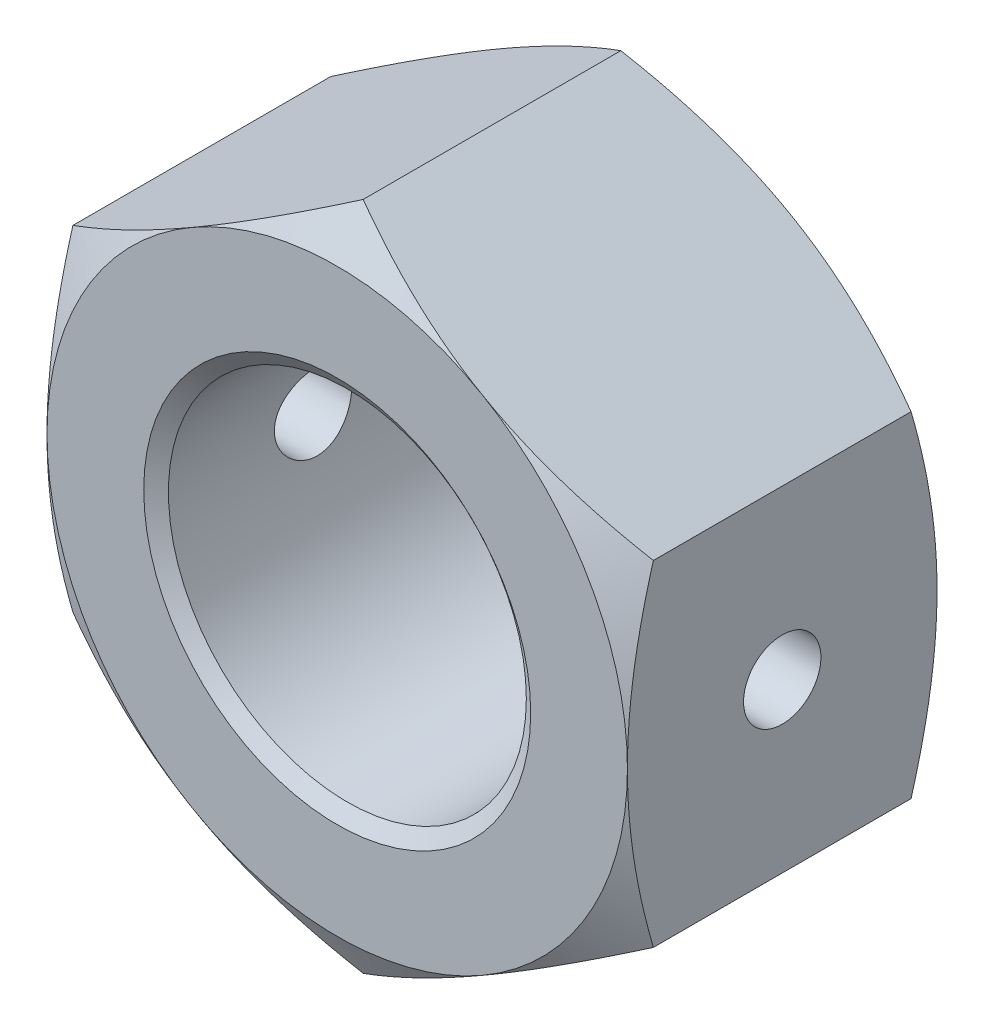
ISO-10303-21;
HEADER;
FILE_DESCRIPTION(('STEP AP214'),'2;1');
FILE_NAME('part.step','',(''),(''),'','','');
FILE_SCHEMA(('AUTOMOTIVE_DESIGN { 1 0 10303 214 1 1 1 1 }'));
ENDSEC;
DATA;
#1=APPLICATION_CONTEXT('core data for automotive mechanical design processes');
#2=APPLICATION_PROTOCOL_DEFINITION('international standard','automotive_design',2000,#1);
#3=PRODUCT_CONTEXT('',#1,'mechanical');
#4=PRODUCT('Part','Part','',(#3));
#5=PRODUCT_RELATED_PRODUCT_CATEGORY('part','',(#4));
#6=PRODUCT_DEFINITION_FORMATION('','',#4);
#7=PRODUCT_DEFINITION_CONTEXT('part definition',#1,'design');
#8=PRODUCT_DEFINITION('design','',#6,#7);
#9=PRODUCT_DEFINITION_SHAPE('','',#8);
#10=(LENGTH_UNIT() NAMED_UNIT(*) SI_UNIT(.MILLI.,.METRE.));
#11=(NAMED_UNIT(*) PLANE_ANGLE_UNIT() SI_UNIT($,.RADIAN.));
#12=(NAMED_UNIT(*) SI_UNIT($,.STERADIAN.) SOLID_ANGLE_UNIT());
#13=UNCERTAINTY_MEASURE_WITH_UNIT(LENGTH_MEASURE(1.E-05),#10,'distance_accuracy_value','');
#14=(GEOMETRIC_REPRESENTATION_CONTEXT(3) GLOBAL_UNCERTAINTY_ASSIGNED_CONTEXT((#13)) GLOBAL_UNIT_ASSIGNED_CONTEXT((#10,
#11,#12)) REPRESENTATION_CONTEXT('',''));
#15=CARTESIAN_POINT('',(0.,0.,0.));
#16=DIRECTION('',(0.,0.,1.));
#17=DIRECTION('',(1.,0.,0.));
#18=AXIS2_PLACEMENT_3D('',#15,#16,#17);
#19=CARTESIAN_POINT('',(0.,0.,-16.));
#20=DIRECTION('',(0.,0.,1.));
#21=DIRECTION('',(1.,0.,0.));
#22=AXIS2_PLACEMENT_3D('',#19,#20,#21);
#23=CYLINDRICAL_SURFACE('',#22,9.25);
#24=CARTESIAN_POINT('',(9.25,0.,-10.));
#25=CARTESIAN_POINT('',(9.24999794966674,0.110956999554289,-9.99999616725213));
#26=CARTESIAN_POINT('',(9.24798323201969,0.221960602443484,-9.99073523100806));
#27=CARTESIAN_POINT('',(9.24014068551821,0.440816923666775,-9.95397337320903));
#28=CARTESIAN_POINT('',(9.23431008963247,0.548667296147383,-9.92645921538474));
#29=CARTESIAN_POINT('',(9.21948523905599,0.758022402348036,-9.85409128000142));
#30=CARTESIAN_POINT('',(9.21049425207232,0.859533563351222,-9.80925540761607));
#31=CARTESIAN_POINT('',(9.19031997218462,1.05358846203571,-9.70357309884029));
#32=CARTESIAN_POINT('',(9.17913674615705,1.14613247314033,-9.64272715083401));
#33=CARTESIAN_POINT('',(9.15560756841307,1.32108311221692,-9.50574067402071));
#34=CARTESIAN_POINT('',(9.14324747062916,1.40332878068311,-9.42939698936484));
#35=CARTESIAN_POINT('',(9.1188577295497,1.55395268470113,-9.26401837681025));
#36=CARTESIAN_POINT('',(9.10682811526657,1.6223297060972,-9.17498233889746));
#37=CARTESIAN_POINT('',(9.08432209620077,1.74398203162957,-8.98556080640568));
#38=CARTESIAN_POINT('',(9.07386382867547,1.79708663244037,-8.88506333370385));
#39=CARTESIAN_POINT('',(9.05588738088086,1.88559188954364,-8.67630750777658));
#40=CARTESIAN_POINT('',(9.04836885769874,1.92099461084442,-8.56805006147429));
#41=CARTESIAN_POINT('',(9.03726711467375,1.97256050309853,-8.34859140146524));
#42=CARTESIAN_POINT('',(9.03362574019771,1.98900830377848,-8.23746007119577));
#43=CARTESIAN_POINT('',(9.03051587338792,2.00308235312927,-8.01396026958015));
#44=CARTESIAN_POINT('',(9.03104688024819,2.00071086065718,-7.90159194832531));
#45=CARTESIAN_POINT('',(9.03616910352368,1.97744284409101,-7.68091919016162));
#46=CARTESIAN_POINT('',(9.04068798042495,1.95687635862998,-7.57257802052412));
#47=CARTESIAN_POINT('',(9.053162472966,1.89832477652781,-7.36092106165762));
#48=CARTESIAN_POINT('',(9.06111827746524,1.86033872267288,-7.25760554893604));
#49=CARTESIAN_POINT('',(9.07964186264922,1.76772157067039,-7.05800160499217));
#50=CARTESIAN_POINT('',(9.09022952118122,1.71296302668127,-6.96177423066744));
#51=CARTESIAN_POINT('',(9.1128115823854,1.58844494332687,-6.7797516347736));
#52=CARTESIAN_POINT('',(9.12480617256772,1.51868340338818,-6.69395780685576));
#53=CARTESIAN_POINT('',(9.14916140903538,1.3643897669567,-6.53333693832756));
#54=CARTESIAN_POINT('',(9.16152443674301,1.27957688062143,-6.45877972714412));
#55=CARTESIAN_POINT('',(9.18499271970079,1.09851231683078,-6.32490378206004));
#56=CARTESIAN_POINT('',(9.19609795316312,1.0022604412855,-6.26558531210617));
#57=CARTESIAN_POINT('',(9.21583415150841,0.800724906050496,-6.1638063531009));
#58=CARTESIAN_POINT('',(9.22446000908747,0.695423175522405,-6.12138059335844));
#59=CARTESIAN_POINT('',(9.23822749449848,0.478957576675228,-6.05490003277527));
#60=CARTESIAN_POINT('',(9.24336961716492,0.367794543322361,-6.03084262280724));
#61=CARTESIAN_POINT('',(9.24952003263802,0.145076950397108,-6.00217267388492));
#62=CARTESIAN_POINT('',(9.25060669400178,0.0335719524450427,-5.99719145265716));
#63=CARTESIAN_POINT('',(9.24874309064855,-0.188676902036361,-6.00581687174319));
#64=CARTESIAN_POINT('',(9.24579309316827,-0.299420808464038,-6.01942228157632));
#65=CARTESIAN_POINT('',(9.23623703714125,-0.515786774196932,-6.06452895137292));
#66=CARTESIAN_POINT('',(9.22967038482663,-0.621450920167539,-6.09583741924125));
#67=CARTESIAN_POINT('',(9.21361577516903,-0.826028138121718,-6.17524794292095));
#68=CARTESIAN_POINT('',(9.20412757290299,-0.92494064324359,-6.22335140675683));
#69=CARTESIAN_POINT('',(9.18308872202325,-1.11473555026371,-6.33575868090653));
#70=CARTESIAN_POINT('',(9.17151106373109,-1.20548617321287,-6.40027982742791));
#71=CARTESIAN_POINT('',(9.1476337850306,-1.37500448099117,-6.5434040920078));
#72=CARTESIAN_POINT('',(9.1353340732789,-1.45377064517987,-6.62200899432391));
#73=CARTESIAN_POINT('',(9.11112915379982,-1.5985369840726,-6.79275948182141));
#74=CARTESIAN_POINT('',(9.09923501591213,-1.66428215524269,-6.88512312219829));
#75=CARTESIAN_POINT('',(9.07744088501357,-1.7793283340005,-7.07979781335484));
#76=CARTESIAN_POINT('',(9.06754080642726,-1.82863004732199,-7.18210843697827));
#77=CARTESIAN_POINT('',(9.05094883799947,-1.90906080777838,-7.39322756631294));
#78=CARTESIAN_POINT('',(9.04423910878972,-1.94029112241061,-7.50199602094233));
#79=CARTESIAN_POINT('',(9.03475453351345,-1.98399084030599,-7.72340015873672));
#80=CARTESIAN_POINT('',(9.03197907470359,-1.99646316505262,-7.83603523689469));
#81=CARTESIAN_POINT('',(9.03071527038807,-2.00217073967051,-8.05940576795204));
#82=CARTESIAN_POINT('',(9.03213686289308,-1.99581010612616,-8.17013057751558));
#83=CARTESIAN_POINT('',(9.03890364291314,-1.96493415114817,-8.38889082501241));
#84=CARTESIAN_POINT('',(9.04424878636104,-1.9404190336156,-8.49692629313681));
#85=CARTESIAN_POINT('',(9.05821699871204,-1.87412321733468,-8.706928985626));
#86=CARTESIAN_POINT('',(9.06682913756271,-1.83240004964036,-8.80891514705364));
#87=CARTESIAN_POINT('',(9.08636550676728,-1.73292240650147,-9.0045003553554));
#88=CARTESIAN_POINT('',(9.0972899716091,-1.67516630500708,-9.09809855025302));
#89=CARTESIAN_POINT('',(9.12049002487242,-1.54391636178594,-9.2762458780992));
#90=CARTESIAN_POINT('',(9.13278805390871,-1.47013397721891,-9.3605795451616));
#91=CARTESIAN_POINT('',(9.1571973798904,-1.30951219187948,-9.51580137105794));
#92=CARTESIAN_POINT('',(9.16930863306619,-1.22266978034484,-9.58668642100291));
#93=CARTESIAN_POINT('',(9.19216084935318,-1.03707347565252,-9.71385329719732));
#94=CARTESIAN_POINT('',(9.20288260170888,-0.938183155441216,-9.76993965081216));
#95=CARTESIAN_POINT('',(9.22155560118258,-0.732169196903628,-9.8646061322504));
#96=CARTESIAN_POINT('',(9.2295091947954,-0.625052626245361,-9.90320109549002));
#97=CARTESIAN_POINT('',(9.24031296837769,-0.431508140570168,-9.95482736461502));
#98=CARTESIAN_POINT('',(9.24392327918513,-0.34613533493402,-9.97173508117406));
#99=CARTESIAN_POINT('',(9.24876754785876,-0.173851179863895,-9.99432266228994));
#100=CARTESIAN_POINT('',(9.2500016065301,-0.0869398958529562,-10.0000030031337));
#101=CARTESIAN_POINT('',(9.25,0.,-10.));
#102=B_SPLINE_CURVE_WITH_KNOTS('',3,(#24,#25,#26,#27,#28,#29,#30,#31,#32,#33,#34,#35,#36,#37,
#38,#39,#40,#41,#42,#43,#44,#45,#46,#47,#48,#49,#50,#51,#52,#53,#54,#55,#56,#57,#58,#59,#60,#61,
#62,#63,#64,#65,#66,#67,#68,#69,#70,#71,#72,#73,#74,#75,#76,#77,#78,#79,#80,#81,#82,#83,#84,#85,
#86,#87,#88,#89,#90,#91,#92,#93,#94,#95,#96,#97,#98,#99,#100,#101),.UNSPECIFIED.,.T.,.F.,(4,2,2,
2,2,2,2,2,2,2,2,2,2,2,2,2,2,2,2,2,2,2,2,2,2,2,2,2,2,2,2,2,2,2,2,2,2,2,4),(0.,0.332552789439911,
0.665346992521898,0.997798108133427,1.33023908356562,1.66735766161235,2.00450574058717,
2.34528747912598,2.68602945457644,3.02158524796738,3.35710076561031,3.68665237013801,
4.01622208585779,4.34836091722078,4.68054406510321,5.01974160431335,5.35894501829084,
5.69884223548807,6.03869116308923,6.37193773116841,6.70516223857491,7.03482584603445,
7.36451709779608,7.69882313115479,8.03317154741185,8.37353170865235,8.7138772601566,
9.05229665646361,9.39066333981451,9.72182235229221,10.0529776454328,10.3830346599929,
10.7131251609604,11.0497411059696,11.3864347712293,11.7273752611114,12.0680260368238,
12.3286074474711,12.5891778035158),.UNSPECIFIED.);
#103=CARTESIAN_POINT('',(9.25,0.,-10.));
#104=VERTEX_POINT('',#103);
#105=EDGE_CURVE('E210',#104,#104,#102,.T.);
#106=ORIENTED_EDGE('',*,*,#105,.T.);
#107=EDGE_LOOP('',(#106));
#108=FACE_BOUND('',#107,.T.);
#109=CARTESIAN_POINT('',(-9.25,0.,-6.));
#110=CARTESIAN_POINT('',(-9.24999794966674,0.110956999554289,-6.00000383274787));
#111=CARTESIAN_POINT('',(-9.24798323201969,0.221960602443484,-6.00926476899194));
#112=CARTESIAN_POINT('',(-9.24014068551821,0.440816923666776,-6.04602662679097));
#113=CARTESIAN_POINT('',(-9.23431008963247,0.548667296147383,-6.07354078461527));
#114=CARTESIAN_POINT('',(-9.21948523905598,0.758022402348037,-6.14590871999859));
#115=CARTESIAN_POINT('',(-9.21049425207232,0.859533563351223,-6.19074459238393));
#116=CARTESIAN_POINT('',(-9.19031997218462,1.05358846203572,-6.29642690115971));
#117=CARTESIAN_POINT('',(-9.17913674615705,1.14613247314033,-6.35727284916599));
#118=CARTESIAN_POINT('',(-9.15560756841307,1.32108311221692,-6.49425932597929));
#119=CARTESIAN_POINT('',(-9.14324747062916,1.40332878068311,-6.57060301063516));
#120=CARTESIAN_POINT('',(-9.1188577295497,1.55395268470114,-6.73598162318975));
#121=CARTESIAN_POINT('',(-9.10682811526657,1.6223297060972,-6.82501766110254));
#122=CARTESIAN_POINT('',(-9.08432209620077,1.74398203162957,-7.01443919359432));
#123=CARTESIAN_POINT('',(-9.07386382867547,1.79708663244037,-7.11493666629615));
#124=CARTESIAN_POINT('',(-9.05588738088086,1.88559188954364,-7.32369249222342));
#125=CARTESIAN_POINT('',(-9.04836885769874,1.92099461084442,-7.43194993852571));
#126=CARTESIAN_POINT('',(-9.03726711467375,1.97256050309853,-7.65140859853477));
#127=CARTESIAN_POINT('',(-9.03362574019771,1.98900830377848,-7.76253992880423));
#128=CARTESIAN_POINT('',(-9.03051587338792,2.00308235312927,-7.98603973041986));
#129=CARTESIAN_POINT('',(-9.03104688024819,2.00071086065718,-8.09840805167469));
#130=CARTESIAN_POINT('',(-9.03616910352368,1.97744284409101,-8.31908080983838));
#131=CARTESIAN_POINT('',(-9.04068798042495,1.95687635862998,-8.42742197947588));
#132=CARTESIAN_POINT('',(-9.053162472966,1.89832477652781,-8.63907893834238));
#133=CARTESIAN_POINT('',(-9.06111827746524,1.86033872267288,-8.74239445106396));
#134=CARTESIAN_POINT('',(-9.07964186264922,1.76772157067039,-8.94199839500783));
#135=CARTESIAN_POINT('',(-9.09022952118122,1.71296302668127,-9.03822576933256));
#136=CARTESIAN_POINT('',(-9.1128115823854,1.58844494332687,-9.2202483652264));
#137=CARTESIAN_POINT('',(-9.12480617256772,1.51868340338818,-9.30604219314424));
#138=CARTESIAN_POINT('',(-9.14916140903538,1.3643897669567,-9.46666306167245));
#139=CARTESIAN_POINT('',(-9.16152443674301,1.27957688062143,-9.54122027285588));
#140=CARTESIAN_POINT('',(-9.18499271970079,1.09851231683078,-9.67509621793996));
#141=CARTESIAN_POINT('',(-9.19609795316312,1.00226044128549,-9.73441468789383));
#142=CARTESIAN_POINT('',(-9.21583415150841,0.800724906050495,-9.8361936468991));
#143=CARTESIAN_POINT('',(-9.22446000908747,0.695423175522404,-9.87861940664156));
#144=CARTESIAN_POINT('',(-9.23822749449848,0.478957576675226,-9.94509996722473));
#145=CARTESIAN_POINT('',(-9.24336961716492,0.367794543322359,-9.96915737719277));
#146=CARTESIAN_POINT('',(-9.24952003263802,0.145076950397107,-9.99782732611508));
#147=CARTESIAN_POINT('',(-9.25060669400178,0.0335719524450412,-10.0028085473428));
#148=CARTESIAN_POINT('',(-9.24874309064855,-0.188676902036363,-9.99418312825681));
#149=CARTESIAN_POINT('',(-9.24579309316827,-0.299420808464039,-9.98057771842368));
#150=CARTESIAN_POINT('',(-9.23623703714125,-0.515786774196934,-9.93547104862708));
#151=CARTESIAN_POINT('',(-9.22967038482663,-0.62145092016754,-9.90416258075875));
#152=CARTESIAN_POINT('',(-9.21361577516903,-0.82602813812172,-9.82475205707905));
#153=CARTESIAN_POINT('',(-9.20412757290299,-0.924940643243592,-9.77664859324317));
#154=CARTESIAN_POINT('',(-9.18308872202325,-1.11473555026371,-9.66424131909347));
#155=CARTESIAN_POINT('',(-9.17151106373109,-1.20548617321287,-9.59972017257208));
#156=CARTESIAN_POINT('',(-9.1476337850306,-1.37500448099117,-9.45659590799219));
#157=CARTESIAN_POINT('',(-9.1353340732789,-1.45377064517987,-9.37799100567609));
#158=CARTESIAN_POINT('',(-9.11112915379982,-1.5985369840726,-9.20724051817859));
#159=CARTESIAN_POINT('',(-9.09923501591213,-1.6642821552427,-9.11487687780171));
#160=CARTESIAN_POINT('',(-9.07744088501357,-1.7793283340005,-8.92020218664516));
#161=CARTESIAN_POINT('',(-9.06754080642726,-1.82863004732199,-8.81789156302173));
#162=CARTESIAN_POINT('',(-9.05094883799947,-1.90906080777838,-8.60677243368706));
#163=CARTESIAN_POINT('',(-9.04423910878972,-1.94029112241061,-8.49800397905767));
#164=CARTESIAN_POINT('',(-9.03475453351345,-1.98399084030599,-8.27659984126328));
#165=CARTESIAN_POINT('',(-9.03197907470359,-1.99646316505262,-8.16396476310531));
#166=CARTESIAN_POINT('',(-9.03071527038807,-2.00217073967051,-7.94059423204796));
#167=CARTESIAN_POINT('',(-9.03213686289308,-1.99581010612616,-7.82986942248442));
#168=CARTESIAN_POINT('',(-9.03890364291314,-1.96493415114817,-7.61110917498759));
#169=CARTESIAN_POINT('',(-9.04424878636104,-1.9404190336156,-7.50307370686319));
#170=CARTESIAN_POINT('',(-9.05821699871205,-1.87412321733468,-7.293071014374));
#171=CARTESIAN_POINT('',(-9.06682913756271,-1.83240004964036,-7.19108485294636));
#172=CARTESIAN_POINT('',(-9.08636550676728,-1.73292240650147,-6.9954996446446));
#173=CARTESIAN_POINT('',(-9.0972899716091,-1.67516630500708,-6.90190144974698));
#174=CARTESIAN_POINT('',(-9.12049002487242,-1.54391636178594,-6.7237541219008));
#175=CARTESIAN_POINT('',(-9.13278805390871,-1.47013397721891,-6.6394204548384));
#176=CARTESIAN_POINT('',(-9.1571973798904,-1.30951219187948,-6.48419862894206));
#177=CARTESIAN_POINT('',(-9.16930863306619,-1.22266978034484,-6.41331357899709));
#178=CARTESIAN_POINT('',(-9.19216084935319,-1.03707347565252,-6.28614670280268));
#179=CARTESIAN_POINT('',(-9.20288260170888,-0.938183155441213,-6.23006034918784));
#180=CARTESIAN_POINT('',(-9.22155560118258,-0.732169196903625,-6.1353938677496));
#181=CARTESIAN_POINT('',(-9.2295091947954,-0.625052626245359,-6.09679890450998));
#182=CARTESIAN_POINT('',(-9.24031296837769,-0.431508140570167,-6.04517263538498));
#183=CARTESIAN_POINT('',(-9.24392327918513,-0.346135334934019,-6.02826491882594));
#184=CARTESIAN_POINT('',(-9.24876754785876,-0.173851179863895,-6.00567733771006));
#185=CARTESIAN_POINT('',(-9.2500016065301,-0.0869398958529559,-5.99999699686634));
#186=CARTESIAN_POINT('',(-9.25,0.,-6.));
#187=B_SPLINE_CURVE_WITH_KNOTS('',3,(#109,#110,#111,#112,#113,#114,#115,#116,#117,#118,#119,
#120,#121,#122,#123,#124,#125,#126,#127,#128,#129,#130,#131,#132,#133,#134,#135,#136,#137,#138,
#139,#140,#141,#142,#143,#144,#145,#146,#147,#148,#149,#150,#151,#152,#153,#154,#155,#156,#157,
#158,#159,#160,#161,#162,#163,#164,#165,#166,#167,#168,#169,#170,#171,#172,#173,#174,#175,#176,
#177,#178,#179,#180,#181,#182,#183,#184,#185,#186),.UNSPECIFIED.,.T.,.F.,(4,2,2,2,2,2,2,2,2,2,2,
2,2,2,2,2,2,2,2,2,2,2,2,2,2,2,2,2,2,2,2,2,2,2,2,2,2,2,4),(0.,0.332552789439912,
0.665346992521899,0.997798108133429,1.33023908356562,1.66735766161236,2.00450574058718,
2.34528747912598,2.68602945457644,3.02158524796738,3.35710076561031,3.68665237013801,
4.01622208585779,4.34836091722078,4.68054406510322,5.01974160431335,5.35894501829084,
5.69884223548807,6.03869116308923,6.37193773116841,6.70516223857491,7.03482584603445,
7.36451709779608,7.6988231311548,8.03317154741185,8.37353170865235,8.7138772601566,
9.05229665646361,9.39066333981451,9.72182235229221,10.0529776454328,10.3830346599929,
10.7131251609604,11.0497411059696,11.3864347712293,11.7273752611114,12.0680260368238,
12.3286074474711,12.5891778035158),.UNSPECIFIED.);
#188=CARTESIAN_POINT('',(-9.25,0.,-6.));
#189=VERTEX_POINT('',#188);
#190=EDGE_CURVE('E216',#189,#189,#187,.T.);
#191=ORIENTED_EDGE('',*,*,#190,.T.);
#192=EDGE_LOOP('',(#191));
#193=FACE_BOUND('',#192,.T.);
#194=CARTESIAN_POINT('',(0.,0.,-0.525155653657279));
#195=DIRECTION('',(0.,0.,1.));
#196=DIRECTION('',(1.,0.,0.));
#197=AXIS2_PLACEMENT_3D('',#194,#195,#196);
#198=CIRCLE('',#197,9.25);
#199=CARTESIAN_POINT('',(9.25,0.,-0.525155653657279));
#200=VERTEX_POINT('',#199);
#201=EDGE_CURVE('E196',#200,#200,#198,.F.);
#202=ORIENTED_EDGE('',*,*,#201,.F.);
#203=EDGE_LOOP('',(#202));
#204=FACE_BOUND('',#203,.T.);
#205=CARTESIAN_POINT('',(0.,0.,-15.4494443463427));
#206=DIRECTION('',(0.,0.,-1.));
#207=DIRECTION('',(-1.,0.,0.));
#208=AXIS2_PLACEMENT_3D('',#205,#206,#207);
#209=CIRCLE('',#208,9.25);
#210=CARTESIAN_POINT('',(-9.25,0.,-15.4494443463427));
#211=VERTEX_POINT('',#210);
#212=EDGE_CURVE('E50',#211,#211,#209,.F.);
#213=ORIENTED_EDGE('',*,*,#212,.F.);
#214=EDGE_LOOP('',(#213));
#215=FACE_BOUND('',#214,.T.);
#216=ADVANCED_FACE('F45',(#108,#193,#204,#215),#23,.F.);
#217=CARTESIAN_POINT('',(0.,17.3205080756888,-16.));
#218=DIRECTION('',(-0.500000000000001,0.866025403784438,0.));
#219=DIRECTION('',(-0.866025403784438,-0.500000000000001,0.));
#220=AXIS2_PLACEMENT_3D('',#217,#218,#219);
#221=PLANE('',#220);
#222=DIRECTION('',(0.,0.,1.));
#223=VECTOR('',#222,1.);
#224=CARTESIAN_POINT('',(-15.,8.66025403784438,-16.));
#225=LINE('',#224,#223);
#226=CARTESIAN_POINT('',(-15.,8.66025403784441,-14.6602540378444));
#227=VERTEX_POINT('',#226);
#228=CARTESIAN_POINT('',(-15.,8.66025403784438,-1.33974596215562));
#229=VERTEX_POINT('',#228);
#230=EDGE_CURVE('E183',#227,#229,#225,.T.);
#231=ORIENTED_EDGE('',*,*,#230,.T.);
#232=CARTESIAN_POINT('',(-15.0002,8.66013856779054,-1.33981262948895));
#233=CARTESIAN_POINT('',(-14.6705058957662,8.85048754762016,-1.22992178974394));
#234=CARTESIAN_POINT('',(-14.3395258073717,9.04157899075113,-1.12501758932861));
#235=CARTESIAN_POINT('',(-13.674911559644,9.42529420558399,-0.926568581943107));
#236=CARTESIAN_POINT('',(-13.3412765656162,9.61791845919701,-0.833027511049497));
#237=CARTESIAN_POINT('',(-12.6707077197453,10.0050715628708,-0.658562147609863));
#238=CARTESIAN_POINT('',(-12.333767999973,10.199603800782,-0.577667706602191));
#239=CARTESIAN_POINT('',(-11.6575472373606,10.5900200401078,-0.430232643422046));
#240=CARTESIAN_POINT('',(-11.3182663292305,10.7859039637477,-0.363691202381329));
#241=CARTESIAN_POINT('',(-10.6460568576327,11.1740042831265,-0.24779237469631));
#242=CARTESIAN_POINT('',(-10.3131781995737,11.3661918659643,-0.198051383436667));
#243=CARTESIAN_POINT('',(-9.6458955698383,11.7514476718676,-0.114646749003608));
#244=CARTESIAN_POINT('',(-9.3114915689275,11.9445159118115,-0.0809834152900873));
#245=CARTESIAN_POINT('',(-8.64212181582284,12.3309767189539,-0.0305840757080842));
#246=CARTESIAN_POINT('',(-8.30715720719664,12.5243686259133,-0.0138279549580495));
#247=CARTESIAN_POINT('',(-7.63691878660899,12.9113309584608,0.00239660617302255));
#248=CARTESIAN_POINT('',(-7.30164498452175,13.1049013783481,0.00186558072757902));
#249=CARTESIAN_POINT('',(-6.67485311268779,13.4667798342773,-0.0152766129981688));
#250=CARTESIAN_POINT('',(-6.38329037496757,13.6351136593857,-0.0297968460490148));
#251=CARTESIAN_POINT('',(-5.80083556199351,13.9713941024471,-0.0716371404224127));
#252=CARTESIAN_POINT('',(-5.50994353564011,14.1393406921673,-0.0989581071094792));
#253=CARTESIAN_POINT('',(-4.92898814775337,14.4747554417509,-0.165923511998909));
#254=CARTESIAN_POINT('',(-4.63892567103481,14.6422230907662,-0.205578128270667));
#255=CARTESIAN_POINT('',(-4.06016058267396,14.9763732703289,-0.29651510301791));
#256=CARTESIAN_POINT('',(-3.77145806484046,15.1430557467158,-0.347798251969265));
#257=CARTESIAN_POINT('',(-2.89508556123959,15.6490296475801,-0.520386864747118));
#258=CARTESIAN_POINT('',(-2.30995340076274,15.9868558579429,-0.658901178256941));
#259=CARTESIAN_POINT('',(-1.14841408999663,16.6574708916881,-0.973271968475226));
#260=CARTESIAN_POINT('',(-0.571992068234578,16.9902683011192,-1.14905461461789));
#261=CARTESIAN_POINT('',(0.000200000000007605,17.3206235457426,-1.33981262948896));
#262=B_SPLINE_CURVE_WITH_KNOTS('',3,(#232,#233,#234,#235,#236,#237,#238,#239,#240,#241,#242,
#243,#244,#245,#246,#247,#248,#249,#250,#251,#252,#253,#254,#255,#256,#257,#258,#259,#260,#261),
.UNSPECIFIED.,.F.,.F.,(4,2,2,2,2,2,2,2,2,2,2,2,2,2,4),(0.,1.18875411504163,2.37789802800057,
3.56980778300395,4.76164951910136,5.92407379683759,7.08652044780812,8.24758247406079,
9.40860862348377,10.4193068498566,11.4300765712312,12.4416826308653,13.4533574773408,
15.5211962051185,17.5849760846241),.UNSPECIFIED.);
#263=CARTESIAN_POINT('',(-7.50000000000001,12.9903810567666,0.));
#264=VERTEX_POINT('',#263);
#265=EDGE_CURVE('E146',#229,#264,#262,.T.);
#266=ORIENTED_EDGE('',*,*,#265,.T.);
#267=CARTESIAN_POINT('',(0.,17.3205080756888,-1.33974596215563));
#268=VERTEX_POINT('',#267);
#269=EDGE_CURVE('E65',#264,#268,#262,.T.);
#270=ORIENTED_EDGE('',*,*,#269,.T.);
#271=DIRECTION('',(0.,0.,1.));
#272=VECTOR('',#271,1.);
#273=CARTESIAN_POINT('',(0.,17.3205080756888,-16.));
#274=LINE('',#273,#272);
#275=CARTESIAN_POINT('',(0.,17.3205080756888,-14.6602540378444));
#276=VERTEX_POINT('',#275);
#277=EDGE_CURVE('E164',#276,#268,#274,.T.);
#278=ORIENTED_EDGE('',*,*,#277,.F.);
#279=CARTESIAN_POINT('',(-15.0002,8.66013856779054,-14.6601873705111));
#280=CARTESIAN_POINT('',(-14.6705058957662,8.85048754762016,-14.7700782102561));
#281=CARTESIAN_POINT('',(-14.3395258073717,9.04157899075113,-14.8749824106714));
#282=CARTESIAN_POINT('',(-13.674911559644,9.42529420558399,-15.0734314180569));
#283=CARTESIAN_POINT('',(-13.3412765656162,9.61791845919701,-15.1669724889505));
#284=CARTESIAN_POINT('',(-12.6707077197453,10.0050715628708,-15.3414378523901));
#285=CARTESIAN_POINT('',(-12.333767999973,10.199603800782,-15.4223322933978));
#286=CARTESIAN_POINT('',(-11.6575472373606,10.5900200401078,-15.569767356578));
#287=CARTESIAN_POINT('',(-11.3182663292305,10.7859039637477,-15.6363087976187));
#288=CARTESIAN_POINT('',(-10.6460568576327,11.1740042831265,-15.7522076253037));
#289=CARTESIAN_POINT('',(-10.3131781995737,11.3661918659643,-15.8019486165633));
#290=CARTESIAN_POINT('',(-9.6458955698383,11.7514476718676,-15.8853532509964));
#291=CARTESIAN_POINT('',(-9.3114915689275,11.9445159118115,-15.9190165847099));
#292=CARTESIAN_POINT('',(-8.64212181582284,12.3309767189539,-15.9694159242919));
#293=CARTESIAN_POINT('',(-8.30715720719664,12.5243686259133,-15.9861720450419));
#294=CARTESIAN_POINT('',(-7.63691878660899,12.9113309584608,-16.002396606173));
#295=CARTESIAN_POINT('',(-7.30164498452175,13.1049013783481,-16.0018655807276));
#296=CARTESIAN_POINT('',(-6.67485311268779,13.4667798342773,-15.9847233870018));
#297=CARTESIAN_POINT('',(-6.38329037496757,13.6351136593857,-15.970203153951));
#298=CARTESIAN_POINT('',(-5.80083556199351,13.9713941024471,-15.9283628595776));
#299=CARTESIAN_POINT('',(-5.5099435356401,14.1393406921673,-15.9010418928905));
#300=CARTESIAN_POINT('',(-4.92898814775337,14.4747554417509,-15.8340764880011));
#301=CARTESIAN_POINT('',(-4.63892567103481,14.6422230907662,-15.7944218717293));
#302=CARTESIAN_POINT('',(-4.06016058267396,14.9763732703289,-15.7034848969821));
#303=CARTESIAN_POINT('',(-3.77145806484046,15.1430557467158,-15.6522017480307));
#304=CARTESIAN_POINT('',(-2.89508556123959,15.6490296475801,-15.4796131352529));
#305=CARTESIAN_POINT('',(-2.30995340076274,15.9868558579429,-15.3410988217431));
#306=CARTESIAN_POINT('',(-1.14841408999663,16.6574708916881,-15.0267280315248));
#307=CARTESIAN_POINT('',(-0.571992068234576,16.9902683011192,-14.8509453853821));
#308=CARTESIAN_POINT('',(0.00020000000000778,17.3206235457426,-14.660187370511));
#309=B_SPLINE_CURVE_WITH_KNOTS('',3,(#279,#280,#281,#282,#283,#284,#285,#286,#287,#288,#289,
#290,#291,#292,#293,#294,#295,#296,#297,#298,#299,#300,#301,#302,#303,#304,#305,#306,#307,#308),
.UNSPECIFIED.,.F.,.F.,(4,2,2,2,2,2,2,2,2,2,2,2,2,2,4),(0.,1.18875411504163,2.37789802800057,
3.56980778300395,4.76164951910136,5.92407379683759,7.08652044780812,8.24758247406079,
9.40860862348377,10.4193068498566,11.4300765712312,12.4416826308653,13.4533574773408,
15.5211962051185,17.5849760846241),.UNSPECIFIED.);
#310=CARTESIAN_POINT('',(-7.50000000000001,12.9903810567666,-16.));
#311=VERTEX_POINT('',#310);
#312=EDGE_CURVE('E187',#311,#276,#309,.T.);
#313=ORIENTED_EDGE('',*,*,#312,.F.);
#314=EDGE_CURVE('E307',#227,#311,#309,.T.);
#315=ORIENTED_EDGE('',*,*,#314,.F.);
#316=EDGE_LOOP('',(#231,#266,#270,#278,#313,#315));
#317=FACE_BOUND('',#316,.T.);
#318=ADVANCED_FACE('F47',(#317),#221,.T.);
#319=CARTESIAN_POINT('',(15.,8.66025403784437,-16.));
#320=DIRECTION('',(0.500000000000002,0.866025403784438,0.));
#321=DIRECTION('',(-0.866025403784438,0.500000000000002,0.));
#322=AXIS2_PLACEMENT_3D('',#319,#320,#321);
#323=PLANE('',#322);
#324=ORIENTED_EDGE('',*,*,#277,.T.);
#325=CARTESIAN_POINT('',(-0.000199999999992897,17.3206235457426,-1.33981262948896));
#326=CARTESIAN_POINT('',(0.329494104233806,17.130274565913,-1.22992178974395));
#327=CARTESIAN_POINT('',(0.660474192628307,16.939183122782,-1.12501758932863));
#328=CARTESIAN_POINT('',(1.32508844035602,16.5554679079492,-0.926568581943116));
#329=CARTESIAN_POINT('',(1.65872343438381,16.3628436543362,-0.833027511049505));
#330=CARTESIAN_POINT('',(2.32929228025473,15.9756905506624,-0.65856214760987));
#331=CARTESIAN_POINT('',(2.66623200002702,15.7811583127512,-0.577667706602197));
#332=CARTESIAN_POINT('',(3.34245276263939,15.3907420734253,-0.430232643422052));
#333=CARTESIAN_POINT('',(3.68173367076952,15.1948581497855,-0.363691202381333));
#334=CARTESIAN_POINT('',(4.35394314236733,14.8067578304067,-0.247792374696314));
#335=CARTESIAN_POINT('',(4.68682180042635,14.6145702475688,-0.198051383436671));
#336=CARTESIAN_POINT('',(5.35410443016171,14.2293144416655,-0.114646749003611));
#337=CARTESIAN_POINT('',(5.68850843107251,14.0362462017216,-0.0809834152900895));
#338=CARTESIAN_POINT('',(6.35787818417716,13.6497853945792,-0.030584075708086));
#339=CARTESIAN_POINT('',(6.69284279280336,13.4563934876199,-0.0138279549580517));
#340=CARTESIAN_POINT('',(7.36308121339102,13.0694311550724,0.00239660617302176));
#341=CARTESIAN_POINT('',(7.69835501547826,12.8758607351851,0.00186558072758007));
#342=CARTESIAN_POINT('',(8.32514688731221,12.5139822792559,-0.0152766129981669));
#343=CARTESIAN_POINT('',(8.61670962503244,12.3456484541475,-0.0297968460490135));
#344=CARTESIAN_POINT('',(9.19916443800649,12.0093680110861,-0.0716371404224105));
#345=CARTESIAN_POINT('',(9.4900564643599,11.8414214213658,-0.0989581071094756));
#346=CARTESIAN_POINT('',(10.0710118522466,11.5060066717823,-0.165923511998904));
#347=CARTESIAN_POINT('',(10.3610743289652,11.338539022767,-0.205578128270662));
#348=CARTESIAN_POINT('',(10.939839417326,11.0043888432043,-0.296515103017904));
#349=CARTESIAN_POINT('',(11.2285419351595,10.8377063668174,-0.347798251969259));
#350=CARTESIAN_POINT('',(12.1049144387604,10.3317324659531,-0.52038686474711));
#351=CARTESIAN_POINT('',(12.6900465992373,9.99390625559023,-0.658901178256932));
#352=CARTESIAN_POINT('',(13.8515859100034,9.32329122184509,-0.973271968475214));
#353=CARTESIAN_POINT('',(14.4280079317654,8.99049381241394,-1.14905461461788));
#354=CARTESIAN_POINT('',(15.0002,8.66013856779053,-1.33981262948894));
#355=B_SPLINE_CURVE_WITH_KNOTS('',3,(#325,#326,#327,#328,#329,#330,#331,#332,#333,#334,#335,
#336,#337,#338,#339,#340,#341,#342,#343,#344,#345,#346,#347,#348,#349,#350,#351,#352,#353,#354),
.UNSPECIFIED.,.F.,.F.,(4,2,2,2,2,2,2,2,2,2,2,2,2,2,4),(0.,1.18875411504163,2.37789802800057,
3.56980778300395,4.76164951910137,5.9240737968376,7.08652044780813,8.2475824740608,
9.40860862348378,10.4193068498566,11.4300765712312,12.4416826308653,13.4533574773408,
15.5211962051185,17.5849760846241),.UNSPECIFIED.);
#356=CARTESIAN_POINT('',(7.50000000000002,12.9903810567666,0.));
#357=VERTEX_POINT('',#356);
#358=EDGE_CURVE('E156',#268,#357,#355,.T.);
#359=ORIENTED_EDGE('',*,*,#358,.T.);
#360=CARTESIAN_POINT('',(15.,8.66025403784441,-1.33974596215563));
#361=VERTEX_POINT('',#360);
#362=EDGE_CURVE('E72',#357,#361,#355,.T.);
#363=ORIENTED_EDGE('',*,*,#362,.T.);
#364=DIRECTION('',(0.,0.,1.));
#365=VECTOR('',#364,1.);
#366=CARTESIAN_POINT('',(15.,8.66025403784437,-16.));
#367=LINE('',#366,#365);
#368=CARTESIAN_POINT('',(15.,8.66025403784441,-14.6602540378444));
#369=VERTEX_POINT('',#368);
#370=EDGE_CURVE('E155',#369,#361,#367,.T.);
#371=ORIENTED_EDGE('',*,*,#370,.F.);
#372=CARTESIAN_POINT('',(-0.000199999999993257,17.3206235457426,-14.660187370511));
#373=CARTESIAN_POINT('',(0.329494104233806,17.130274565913,-14.770078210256));
#374=CARTESIAN_POINT('',(0.660474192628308,16.939183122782,-14.8749824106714));
#375=CARTESIAN_POINT('',(1.32508844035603,16.5554679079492,-15.0734314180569));
#376=CARTESIAN_POINT('',(1.65872343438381,16.3628436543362,-15.1669724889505));
#377=CARTESIAN_POINT('',(2.32929228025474,15.9756905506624,-15.3414378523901));
#378=CARTESIAN_POINT('',(2.66623200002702,15.7811583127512,-15.4223322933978));
#379=CARTESIAN_POINT('',(3.34245276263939,15.3907420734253,-15.5697673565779));
#380=CARTESIAN_POINT('',(3.68173367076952,15.1948581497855,-15.6363087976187));
#381=CARTESIAN_POINT('',(4.35394314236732,14.8067578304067,-15.7522076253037));
#382=CARTESIAN_POINT('',(4.68682180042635,14.6145702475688,-15.8019486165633));
#383=CARTESIAN_POINT('',(5.3541044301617,14.2293144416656,-15.8853532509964));
#384=CARTESIAN_POINT('',(5.6885084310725,14.0362462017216,-15.9190165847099));
#385=CARTESIAN_POINT('',(6.35787818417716,13.6497853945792,-15.9694159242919));
#386=CARTESIAN_POINT('',(6.69284279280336,13.4563934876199,-15.9861720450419));
#387=CARTESIAN_POINT('',(7.36308121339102,13.0694311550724,-16.002396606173));
#388=CARTESIAN_POINT('',(7.69835501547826,12.8758607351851,-16.0018655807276));
#389=CARTESIAN_POINT('',(8.32514688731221,12.5139822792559,-15.9847233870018));
#390=CARTESIAN_POINT('',(8.61670962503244,12.3456484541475,-15.970203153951));
#391=CARTESIAN_POINT('',(9.19916443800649,12.0093680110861,-15.9283628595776));
#392=CARTESIAN_POINT('',(9.4900564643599,11.8414214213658,-15.9010418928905));
#393=CARTESIAN_POINT('',(10.0710118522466,11.5060066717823,-15.8340764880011));
#394=CARTESIAN_POINT('',(10.3610743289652,11.338539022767,-15.7944218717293));
#395=CARTESIAN_POINT('',(10.939839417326,11.0043888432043,-15.7034848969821));
#396=CARTESIAN_POINT('',(11.2285419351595,10.8377063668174,-15.6522017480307));
#397=CARTESIAN_POINT('',(12.1049144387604,10.3317324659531,-15.4796131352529));
#398=CARTESIAN_POINT('',(12.6900465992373,9.99390625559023,-15.3410988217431));
#399=CARTESIAN_POINT('',(13.8515859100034,9.32329122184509,-15.0267280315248));
#400=CARTESIAN_POINT('',(14.4280079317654,8.99049381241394,-14.8509453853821));
#401=CARTESIAN_POINT('',(15.0002,8.66013856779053,-14.6601873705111));
#402=B_SPLINE_CURVE_WITH_KNOTS('',3,(#372,#373,#374,#375,#376,#377,#378,#379,#380,#381,#382,
#383,#384,#385,#386,#387,#388,#389,#390,#391,#392,#393,#394,#395,#396,#397,#398,#399,#400,#401),
.UNSPECIFIED.,.F.,.F.,(4,2,2,2,2,2,2,2,2,2,2,2,2,2,4),(0.,1.18875411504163,2.37789802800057,
3.56980778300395,4.76164951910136,5.92407379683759,7.08652044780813,8.24758247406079,
9.40860862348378,10.4193068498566,11.4300765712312,12.4416826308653,13.4533574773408,
15.5211962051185,17.5849760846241),.UNSPECIFIED.);
#403=CARTESIAN_POINT('',(7.50000000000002,12.9903810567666,-16.));
#404=VERTEX_POINT('',#403);
#405=EDGE_CURVE('E299',#404,#369,#402,.T.);
#406=ORIENTED_EDGE('',*,*,#405,.F.);
#407=EDGE_CURVE('E306',#276,#404,#402,.T.);
#408=ORIENTED_EDGE('',*,*,#407,.F.);
#409=EDGE_LOOP('',(#324,#359,#363,#371,#406,#408));
#410=FACE_BOUND('',#409,.T.);
#411=ADVANCED_FACE('F153',(#410),#323,.T.);
#412=CARTESIAN_POINT('',(15.,8.66025403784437,-16.));
#413=DIRECTION('',(-1.,0.,0.));
#414=DIRECTION('',(0.,0.,1.));
#415=AXIS2_PLACEMENT_3D('',#412,#413,#414);
#416=PLANE('',#415);
#417=CARTESIAN_POINT('',(15.,0.,-8.));
#418=DIRECTION('',(-1.,0.,0.));
#419=DIRECTION('',(0.,0.,1.));
#420=AXIS2_PLACEMENT_3D('',#417,#418,#419);
#421=CIRCLE('',#420,2.);
#422=CARTESIAN_POINT('',(15.,0.,-6.));
#423=VERTEX_POINT('',#422);
#424=EDGE_CURVE('E366',#423,#423,#421,.T.);
#425=ORIENTED_EDGE('',*,*,#424,.T.);
#426=EDGE_LOOP('',(#425));
#427=FACE_BOUND('',#426,.T.);
#428=CARTESIAN_POINT('',(15.,-22.9682699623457,-7.1779005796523));
#429=CARTESIAN_POINT('',(15.,-22.6389897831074,-7.01873142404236));
#430=CARTESIAN_POINT('',(15.,-22.3093116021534,-6.8603860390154));
#431=CARTESIAN_POINT('',(15.,-21.6490751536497,-6.54553189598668));
#432=CARTESIAN_POINT('',(15.,-21.3185168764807,-6.38902315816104));
#433=CARTESIAN_POINT('',(15.,-20.3252989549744,-5.92249019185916));
#434=CARTESIAN_POINT('',(15.,-19.6612032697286,-5.61551110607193));
#435=CARTESIAN_POINT('',(15.,-18.3246226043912,-5.00989859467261));
#436=CARTESIAN_POINT('',(15.,-17.6521113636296,-4.711322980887));
#437=CARTESIAN_POINT('',(15.,-16.3015621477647,-4.12699119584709));
#438=CARTESIAN_POINT('',(15.,-15.6235244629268,-3.84123435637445));
#439=CARTESIAN_POINT('',(15.,-14.2524269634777,-3.28256457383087));
#440=CARTESIAN_POINT('',(15.,-13.5592849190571,-3.00985238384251));
#441=CARTESIAN_POINT('',(15.,-12.1648203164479,-2.48578579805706));
#442=CARTESIAN_POINT('',(15.,-11.4634968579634,-2.23443377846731));
#443=CARTESIAN_POINT('',(15.,-10.0530172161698,-1.75984469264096));
#444=CARTESIAN_POINT('',(15.,-9.34388131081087,-1.53654785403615));
#445=CARTESIAN_POINT('',(15.,-7.91545988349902,-1.12531011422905));
#446=CARTESIAN_POINT('',(15.,-7.19617764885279,-0.937358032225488));
#447=CARTESIAN_POINT('',(15.,-6.10950776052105,-0.688818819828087));
#448=CARTESIAN_POINT('',(15.,-5.74591626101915,-0.611524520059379));
#449=CARTESIAN_POINT('',(15.,-5.01631310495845,-0.469286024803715));
#450=CARTESIAN_POINT('',(15.,-4.65030150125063,-0.404341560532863));
#451=CARTESIAN_POINT('',(15.,-3.91609659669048,-0.287952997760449));
#452=CARTESIAN_POINT('',(15.,-3.54790312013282,-0.23651000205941));
#453=CARTESIAN_POINT('',(15.,-2.80977894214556,-0.148161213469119));
#454=CARTESIAN_POINT('',(15.,-2.4398483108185,-0.11125483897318));
#455=CARTESIAN_POINT('',(15.,-1.70111543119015,-0.0529692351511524));
#456=CARTESIAN_POINT('',(15.,-1.33232087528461,-0.0314931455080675));
#457=CARTESIAN_POINT('',(15.,-0.594154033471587,-0.00418216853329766));
#458=CARTESIAN_POINT('',(15.,-0.224781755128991,0.00165292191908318));
#459=CARTESIAN_POINT('',(15.,0.513772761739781,-0.00245653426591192));
#460=CARTESIAN_POINT('',(15.,0.882955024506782,-0.0123966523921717));
#461=CARTESIAN_POINT('',(15.,1.62057875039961,-0.0478095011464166));
#462=CARTESIAN_POINT('',(15.,1.98902017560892,-0.0732830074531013));
#463=CARTESIAN_POINT('',(15.,2.8820087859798,-0.153315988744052));
#464=CARTESIAN_POINT('',(15.,3.40586988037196,-0.215658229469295));
#465=CARTESIAN_POINT('',(15.,4.44957771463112,-0.368284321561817));
#466=CARTESIAN_POINT('',(15.,4.96942331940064,-0.458575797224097));
#467=CARTESIAN_POINT('',(15.,6.0046714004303,-0.663898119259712));
#468=CARTESIAN_POINT('',(15.,6.52006919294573,-0.778952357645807));
#469=CARTESIAN_POINT('',(15.,7.54556200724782,-1.030289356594));
#470=CARTESIAN_POINT('',(15.,8.05565752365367,-1.1665701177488));
#471=CARTESIAN_POINT('',(15.,9.08310964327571,-1.46066370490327));
#472=CARTESIAN_POINT('',(15.,9.6003377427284,-1.61892244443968));
#473=CARTESIAN_POINT('',(15.,10.6293258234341,-1.95107200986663));
#474=CARTESIAN_POINT('',(15.,11.1410893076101,-2.1249520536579));
#475=CARTESIAN_POINT('',(15.,12.1570993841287,-2.48477464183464));
#476=CARTESIAN_POINT('',(15.,12.6613720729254,-2.67064378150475));
#477=CARTESIAN_POINT('',(15.,13.4147912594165,-2.95756327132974));
#478=CARTESIAN_POINT('',(15.,13.665486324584,-3.05457748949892));
#479=CARTESIAN_POINT('',(15.,14.1659013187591,-3.2510732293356));
#480=CARTESIAN_POINT('',(15.,14.4156212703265,-3.3505546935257));
#481=CARTESIAN_POINT('',(15.,14.6648887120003,-3.4511587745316));
#482=B_SPLINE_CURVE_WITH_KNOTS('',3,(#428,#429,#430,#431,#432,#433,#434,#435,#436,#437,#438,
#439,#440,#441,#442,#443,#444,#445,#446,#447,#448,#449,#450,#451,#452,#453,#454,#455,#456,#457,
#458,#459,#460,#461,#462,#463,#464,#465,#466,#467,#468,#469,#470,#471,#472,#473,#474,#475,#476,
#477,#478,#479,#480,#481),.UNSPECIFIED.,.F.,.F.,(4,2,2,2,2,2,2,2,2,2,2,2,2,2,2,2,2,2,2,2,2,2,2,
2,2,2,4),(0.,1.09719534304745,2.19440272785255,4.38917437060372,6.59650580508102,
8.80372204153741,11.0380360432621,13.2725982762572,15.502315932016,17.7313270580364,
18.8463006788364,19.9612500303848,21.0762904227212,22.1912861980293,23.2992201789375,
24.4071397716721,25.5147483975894,26.6224123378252,28.2042036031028,29.7864267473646,
31.3701511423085,32.9537264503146,34.5761185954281,36.1973994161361,37.8095545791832,
38.6159794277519,39.4223855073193),.UNSPECIFIED.);
#483=CARTESIAN_POINT('',(15.,-8.66025403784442,-1.33974596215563));
#484=VERTEX_POINT('',#483);
#485=CARTESIAN_POINT('',(15.,0.,0.));
#486=VERTEX_POINT('',#485);
#487=EDGE_CURVE('E148',#484,#486,#482,.T.);
#488=ORIENTED_EDGE('',*,*,#487,.F.);
#489=DIRECTION('',(0.,0.,1.));
#490=VECTOR('',#489,1.);
#491=CARTESIAN_POINT('',(15.,-8.66025403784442,-16.));
#492=LINE('',#491,#490);
#493=CARTESIAN_POINT('',(15.,-8.66025403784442,-14.6602540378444));
#494=VERTEX_POINT('',#493);
#495=EDGE_CURVE('E165',#494,#484,#492,.T.);
#496=ORIENTED_EDGE('',*,*,#495,.F.);
#497=CARTESIAN_POINT('',(15.,-22.9682699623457,-8.8220994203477));
#498=CARTESIAN_POINT('',(15.,-22.6389897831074,-8.98126857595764));
#499=CARTESIAN_POINT('',(15.,-22.3093116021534,-9.1396139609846));
#500=CARTESIAN_POINT('',(15.,-21.6490751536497,-9.45446810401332));
#501=CARTESIAN_POINT('',(15.,-21.3185168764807,-9.61097684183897));
#502=CARTESIAN_POINT('',(15.,-20.3252989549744,-10.0775098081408));
#503=CARTESIAN_POINT('',(15.,-19.6612032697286,-10.3844888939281));
#504=CARTESIAN_POINT('',(15.,-18.3246226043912,-10.9901014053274));
#505=CARTESIAN_POINT('',(15.,-17.6521113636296,-11.288677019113));
#506=CARTESIAN_POINT('',(15.,-16.3015621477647,-11.8730088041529));
#507=CARTESIAN_POINT('',(15.,-15.6235244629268,-12.1587656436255));
#508=CARTESIAN_POINT('',(15.,-14.2524269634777,-12.7174354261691));
#509=CARTESIAN_POINT('',(15.,-13.5592849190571,-12.9901476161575));
#510=CARTESIAN_POINT('',(15.,-12.1648203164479,-13.5142142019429));
#511=CARTESIAN_POINT('',(15.,-11.4634968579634,-13.7655662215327));
#512=CARTESIAN_POINT('',(15.,-10.0530172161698,-14.240155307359));
#513=CARTESIAN_POINT('',(15.,-9.34388131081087,-14.4634521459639));
#514=CARTESIAN_POINT('',(15.,-7.91545988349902,-14.874689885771));
#515=CARTESIAN_POINT('',(15.,-7.19617764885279,-15.0626419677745));
#516=CARTESIAN_POINT('',(15.,-6.10950776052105,-15.3111811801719));
#517=CARTESIAN_POINT('',(15.,-5.74591626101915,-15.3884754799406));
#518=CARTESIAN_POINT('',(15.,-5.01631310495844,-15.5307139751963));
#519=CARTESIAN_POINT('',(15.,-4.65030150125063,-15.5956584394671));
#520=CARTESIAN_POINT('',(15.,-3.91609659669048,-15.7120470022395));
#521=CARTESIAN_POINT('',(15.,-3.54790312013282,-15.7634899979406));
#522=CARTESIAN_POINT('',(15.,-2.80977894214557,-15.8518387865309));
#523=CARTESIAN_POINT('',(15.,-2.4398483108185,-15.8887451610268));
#524=CARTESIAN_POINT('',(15.,-1.70111543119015,-15.9470307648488));
#525=CARTESIAN_POINT('',(15.,-1.33232087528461,-15.9685068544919));
#526=CARTESIAN_POINT('',(15.,-0.594154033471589,-15.9958178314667));
#527=CARTESIAN_POINT('',(15.,-0.224781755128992,-16.0016529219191));
#528=CARTESIAN_POINT('',(15.,0.513772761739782,-15.9975434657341));
#529=CARTESIAN_POINT('',(15.,0.882955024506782,-15.9876033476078));
#530=CARTESIAN_POINT('',(15.,1.62057875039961,-15.9521904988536));
#531=CARTESIAN_POINT('',(15.,1.98902017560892,-15.9267169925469));
#532=CARTESIAN_POINT('',(15.,2.8820087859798,-15.8466840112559));
#533=CARTESIAN_POINT('',(15.,3.40586988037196,-15.7843417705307));
#534=CARTESIAN_POINT('',(15.,4.44957771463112,-15.6317156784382));
#535=CARTESIAN_POINT('',(15.,4.96942331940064,-15.5414242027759));
#536=CARTESIAN_POINT('',(15.,6.0046714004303,-15.3361018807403));
#537=CARTESIAN_POINT('',(15.,6.52006919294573,-15.2210476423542));
#538=CARTESIAN_POINT('',(15.,7.54556200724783,-14.969710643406));
#539=CARTESIAN_POINT('',(15.,8.05565752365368,-14.8334298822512));
#540=CARTESIAN_POINT('',(15.,9.08310964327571,-14.5393362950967));
#541=CARTESIAN_POINT('',(15.,9.6003377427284,-14.3810775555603));
#542=CARTESIAN_POINT('',(15.,10.6293258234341,-14.0489279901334));
#543=CARTESIAN_POINT('',(15.,11.1410893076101,-13.8750479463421));
#544=CARTESIAN_POINT('',(15.,12.1570993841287,-13.5152253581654));
#545=CARTESIAN_POINT('',(15.,12.6613720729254,-13.3293562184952));
#546=CARTESIAN_POINT('',(15.,13.4147912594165,-13.0424367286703));
#547=CARTESIAN_POINT('',(15.,13.665486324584,-12.9454225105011));
#548=CARTESIAN_POINT('',(15.,14.1659013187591,-12.7489267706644));
#549=CARTESIAN_POINT('',(15.,14.4156212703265,-12.6494453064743));
#550=CARTESIAN_POINT('',(15.,14.6648887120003,-12.5488412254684));
#551=B_SPLINE_CURVE_WITH_KNOTS('',3,(#497,#498,#499,#500,#501,#502,#503,#504,#505,#506,#507,
#508,#509,#510,#511,#512,#513,#514,#515,#516,#517,#518,#519,#520,#521,#522,#523,#524,#525,#526,
#527,#528,#529,#530,#531,#532,#533,#534,#535,#536,#537,#538,#539,#540,#541,#542,#543,#544,#545,
#546,#547,#548,#549,#550),.UNSPECIFIED.,.F.,.F.,(4,2,2,2,2,2,2,2,2,2,2,2,2,2,2,2,2,2,2,2,2,2,2,
2,2,2,4),(0.,1.09719534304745,2.19440272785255,4.38917437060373,6.59650580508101,
8.80372204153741,11.0380360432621,13.2725982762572,15.502315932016,17.7313270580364,
18.8463006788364,19.9612500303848,21.0762904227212,22.1912861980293,23.2992201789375,
24.4071397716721,25.5147483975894,26.6224123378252,28.2042036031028,29.7864267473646,
31.3701511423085,32.9537264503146,34.5761185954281,36.1973994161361,37.8095545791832,
38.6159794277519,39.4223855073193),.UNSPECIFIED.);
#552=CARTESIAN_POINT('',(15.,0.,-16.));
#553=VERTEX_POINT('',#552);
#554=EDGE_CURVE('E315',#494,#553,#551,.T.);
#555=ORIENTED_EDGE('',*,*,#554,.T.);
#556=EDGE_CURVE('E162',#553,#369,#551,.T.);
#557=ORIENTED_EDGE('',*,*,#556,.T.);
#558=ORIENTED_EDGE('',*,*,#370,.T.);
#559=EDGE_CURVE('E137',#486,#361,#482,.T.);
#560=ORIENTED_EDGE('',*,*,#559,.F.);
#561=EDGE_LOOP('',(#488,#496,#555,#557,#558,#560));
#562=FACE_BOUND('',#561,.T.);
#563=ADVANCED_FACE('F160',(#427,#562),#416,.F.);
#564=CARTESIAN_POINT('',(0.,-17.3205080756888,-16.));
#565=DIRECTION('',(0.500000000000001,-0.866025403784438,0.));
#566=DIRECTION('',(0.866025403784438,0.500000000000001,0.));
#567=AXIS2_PLACEMENT_3D('',#564,#565,#566);
#568=PLANE('',#567);
#569=ORIENTED_EDGE('',*,*,#495,.T.);
#570=CARTESIAN_POINT('',(15.0002,-8.66013856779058,-1.33981262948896));
#571=CARTESIAN_POINT('',(14.6705058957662,-8.85048754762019,-1.22992178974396));
#572=CARTESIAN_POINT('',(14.3395258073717,-9.04157899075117,-1.12501758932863));
#573=CARTESIAN_POINT('',(13.674911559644,-9.42529420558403,-0.926568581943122));
#574=CARTESIAN_POINT('',(13.3412765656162,-9.61791845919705,-0.833027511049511));
#575=CARTESIAN_POINT('',(12.6707077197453,-10.0050715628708,-0.658562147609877));
#576=CARTESIAN_POINT('',(12.333767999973,-10.199603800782,-0.577667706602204));
#577=CARTESIAN_POINT('',(11.6575472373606,-10.5900200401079,-0.43023264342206));
#578=CARTESIAN_POINT('',(11.3182663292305,-10.7859039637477,-0.363691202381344));
#579=CARTESIAN_POINT('',(10.6460568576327,-11.1740042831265,-0.247792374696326));
#580=CARTESIAN_POINT('',(10.3131781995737,-11.3661918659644,-0.198051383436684));
#581=CARTESIAN_POINT('',(9.6458955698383,-11.7514476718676,-0.114646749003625));
#582=CARTESIAN_POINT('',(9.3114915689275,-11.9445159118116,-0.0809834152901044));
#583=CARTESIAN_POINT('',(8.64212181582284,-12.330976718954,-0.0305840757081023));
#584=CARTESIAN_POINT('',(8.30715720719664,-12.5243686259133,-0.0138279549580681));
#585=CARTESIAN_POINT('',(7.63691878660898,-12.9113309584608,0.00239660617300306));
#586=CARTESIAN_POINT('',(7.30164498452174,-13.1049013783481,0.00186558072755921));
#587=CARTESIAN_POINT('',(6.67485311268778,-13.4667798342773,-0.0152766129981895));
#588=CARTESIAN_POINT('',(6.38329037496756,-13.6351136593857,-0.029796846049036));
#589=CARTESIAN_POINT('',(5.80083556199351,-13.9713941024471,-0.0716371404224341));
#590=CARTESIAN_POINT('',(5.5099435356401,-14.1393406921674,-0.0989581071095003));
#591=CARTESIAN_POINT('',(4.92898814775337,-14.4747554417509,-0.165923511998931));
#592=CARTESIAN_POINT('',(4.63892567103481,-14.6422230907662,-0.205578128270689));
#593=CARTESIAN_POINT('',(4.06016058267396,-14.9763732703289,-0.296515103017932));
#594=CARTESIAN_POINT('',(3.77145806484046,-15.1430557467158,-0.347798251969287));
#595=CARTESIAN_POINT('',(2.89508556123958,-15.6490296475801,-0.520386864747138));
#596=CARTESIAN_POINT('',(2.30995340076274,-15.986855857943,-0.658901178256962));
#597=CARTESIAN_POINT('',(1.14841408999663,-16.6574708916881,-0.973271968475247));
#598=CARTESIAN_POINT('',(0.571992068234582,-16.9902683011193,-1.14905461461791));
#599=CARTESIAN_POINT('',(-0.000200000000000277,-17.3206235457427,-1.33981262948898));
#600=B_SPLINE_CURVE_WITH_KNOTS('',3,(#570,#571,#572,#573,#574,#575,#576,#577,#578,#579,#580,
#581,#582,#583,#584,#585,#586,#587,#588,#589,#590,#591,#592,#593,#594,#595,#596,#597,#598,#599),
.UNSPECIFIED.,.F.,.F.,(4,2,2,2,2,2,2,2,2,2,2,2,2,2,4),(0.,1.18875411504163,2.37789802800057,
3.56980778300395,4.76164951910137,5.92407379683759,7.08652044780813,8.2475824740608,
9.40860862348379,10.4193068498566,11.4300765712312,12.4416826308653,13.4533574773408,
15.5211962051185,17.5849760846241),.UNSPECIFIED.);
#601=CARTESIAN_POINT('',(7.50000000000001,-12.9903810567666,0.));
#602=VERTEX_POINT('',#601);
#603=EDGE_CURVE('E428',#484,#602,#600,.T.);
#604=ORIENTED_EDGE('',*,*,#603,.T.);
#605=CARTESIAN_POINT('',(0.,-17.3205080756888,-1.33974596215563));
#606=VERTEX_POINT('',#605);
#607=EDGE_CURVE('E266',#602,#606,#600,.T.);
#608=ORIENTED_EDGE('',*,*,#607,.T.);
#609=DIRECTION('',(0.,0.,1.));
#610=VECTOR('',#609,1.);
#611=CARTESIAN_POINT('',(0.,-17.3205080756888,-16.));
#612=LINE('',#611,#610);
#613=CARTESIAN_POINT('',(0.,-17.3205080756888,-14.6602540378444));
#614=VERTEX_POINT('',#613);
#615=EDGE_CURVE('E172',#614,#606,#612,.T.);
#616=ORIENTED_EDGE('',*,*,#615,.F.);
#617=CARTESIAN_POINT('',(15.0002,-8.66013856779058,-14.660187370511));
#618=CARTESIAN_POINT('',(14.6705058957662,-8.85048754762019,-14.770078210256));
#619=CARTESIAN_POINT('',(14.3395258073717,-9.04157899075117,-14.8749824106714));
#620=CARTESIAN_POINT('',(13.674911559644,-9.42529420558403,-15.0734314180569));
#621=CARTESIAN_POINT('',(13.3412765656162,-9.61791845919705,-15.1669724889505));
#622=CARTESIAN_POINT('',(12.6707077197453,-10.0050715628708,-15.3414378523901));
#623=CARTESIAN_POINT('',(12.333767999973,-10.199603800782,-15.4223322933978));
#624=CARTESIAN_POINT('',(11.6575472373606,-10.5900200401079,-15.5697673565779));
#625=CARTESIAN_POINT('',(11.3182663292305,-10.7859039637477,-15.6363087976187));
#626=CARTESIAN_POINT('',(10.6460568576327,-11.1740042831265,-15.7522076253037));
#627=CARTESIAN_POINT('',(10.3131781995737,-11.3661918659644,-15.8019486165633));
#628=CARTESIAN_POINT('',(9.6458955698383,-11.7514476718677,-15.8853532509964));
#629=CARTESIAN_POINT('',(9.3114915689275,-11.9445159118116,-15.9190165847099));
#630=CARTESIAN_POINT('',(8.64212181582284,-12.330976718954,-15.9694159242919));
#631=CARTESIAN_POINT('',(8.30715720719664,-12.5243686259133,-15.9861720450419));
#632=CARTESIAN_POINT('',(7.63691878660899,-12.9113309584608,-16.002396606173));
#633=CARTESIAN_POINT('',(7.30164498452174,-13.1049013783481,-16.0018655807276));
#634=CARTESIAN_POINT('',(6.67485311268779,-13.4667798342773,-15.9847233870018));
#635=CARTESIAN_POINT('',(6.38329037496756,-13.6351136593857,-15.970203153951));
#636=CARTESIAN_POINT('',(5.80083556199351,-13.9713941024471,-15.9283628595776));
#637=CARTESIAN_POINT('',(5.5099435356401,-14.1393406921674,-15.9010418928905));
#638=CARTESIAN_POINT('',(4.92898814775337,-14.4747554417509,-15.8340764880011));
#639=CARTESIAN_POINT('',(4.63892567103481,-14.6422230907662,-15.7944218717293));
#640=CARTESIAN_POINT('',(4.06016058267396,-14.9763732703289,-15.7034848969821));
#641=CARTESIAN_POINT('',(3.77145806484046,-15.1430557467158,-15.6522017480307));
#642=CARTESIAN_POINT('',(2.89508556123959,-15.6490296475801,-15.4796131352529));
#643=CARTESIAN_POINT('',(2.30995340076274,-15.986855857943,-15.341098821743));
#644=CARTESIAN_POINT('',(1.14841408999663,-16.6574708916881,-15.0267280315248));
#645=CARTESIAN_POINT('',(0.571992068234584,-16.9902683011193,-14.8509453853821));
#646=CARTESIAN_POINT('',(-0.000200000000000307,-17.3206235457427,-14.660187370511));
#647=B_SPLINE_CURVE_WITH_KNOTS('',3,(#617,#618,#619,#620,#621,#622,#623,#624,#625,#626,#627,
#628,#629,#630,#631,#632,#633,#634,#635,#636,#637,#638,#639,#640,#641,#642,#643,#644,#645,#646),
.UNSPECIFIED.,.F.,.F.,(4,2,2,2,2,2,2,2,2,2,2,2,2,2,4),(0.,1.18875411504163,2.37789802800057,
3.56980778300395,4.76164951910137,5.9240737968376,7.08652044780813,8.2475824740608,
9.40860862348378,10.4193068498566,11.4300765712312,12.4416826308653,13.4533574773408,
15.5211962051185,17.5849760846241),.UNSPECIFIED.);
#648=CARTESIAN_POINT('',(7.50000000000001,-12.9903810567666,-16.));
#649=VERTEX_POINT('',#648);
#650=EDGE_CURVE('E323',#649,#614,#647,.T.);
#651=ORIENTED_EDGE('',*,*,#650,.F.);
#652=EDGE_CURVE('E322',#494,#649,#647,.T.);
#653=ORIENTED_EDGE('',*,*,#652,.F.);
#654=EDGE_LOOP('',(#569,#604,#608,#616,#651,#653));
#655=FACE_BOUND('',#654,.T.);
#656=ADVANCED_FACE('F336',(#655),#568,.T.);
#657=CARTESIAN_POINT('',(-15.,-8.66025403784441,-16.));
#658=DIRECTION('',(-0.500000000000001,-0.866025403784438,0.));
#659=DIRECTION('',(0.866025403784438,-0.500000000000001,0.));
#660=AXIS2_PLACEMENT_3D('',#657,#658,#659);
#661=PLANE('',#660);
#662=ORIENTED_EDGE('',*,*,#615,.T.);
#663=CARTESIAN_POINT('',(0.00019999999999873,-17.3206235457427,-1.33981262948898));
#664=CARTESIAN_POINT('',(-0.329494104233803,-17.130274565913,-1.22992178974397));
#665=CARTESIAN_POINT('',(-0.660474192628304,-16.9391831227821,-1.12501758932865));
#666=CARTESIAN_POINT('',(-1.32508844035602,-16.5554679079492,-0.926568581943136));
#667=CARTESIAN_POINT('',(-1.65872343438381,-16.3628436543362,-0.833027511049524));
#668=CARTESIAN_POINT('',(-2.32929228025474,-15.9756905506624,-0.658562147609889));
#669=CARTESIAN_POINT('',(-2.66623200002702,-15.7811583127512,-0.577667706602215));
#670=CARTESIAN_POINT('',(-3.34245276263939,-15.3907420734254,-0.43023264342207));
#671=CARTESIAN_POINT('',(-3.68173367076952,-15.1948581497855,-0.363691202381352));
#672=CARTESIAN_POINT('',(-4.35394314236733,-14.8067578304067,-0.247792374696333));
#673=CARTESIAN_POINT('',(-4.68682180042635,-14.6145702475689,-0.198051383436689));
#674=CARTESIAN_POINT('',(-5.35410443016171,-14.2293144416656,-0.114646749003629));
#675=CARTESIAN_POINT('',(-5.68850843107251,-14.0362462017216,-0.0809834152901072));
#676=CARTESIAN_POINT('',(-6.35787818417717,-13.6497853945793,-0.0305840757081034));
#677=CARTESIAN_POINT('',(-6.69284279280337,-13.4563934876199,-0.0138279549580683));
#678=CARTESIAN_POINT('',(-7.36308121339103,-13.0694311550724,0.00239660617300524));
#679=CARTESIAN_POINT('',(-7.69835501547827,-12.8758607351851,0.00186558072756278));
#680=CARTESIAN_POINT('',(-8.32514688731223,-12.5139822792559,-0.0152766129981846));
#681=CARTESIAN_POINT('',(-8.61670962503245,-12.3456484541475,-0.0297968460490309));
#682=CARTESIAN_POINT('',(-9.1991644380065,-12.0093680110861,-0.0716371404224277));
#683=CARTESIAN_POINT('',(-9.49005646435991,-11.8414214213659,-0.0989581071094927));
#684=CARTESIAN_POINT('',(-10.0710118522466,-11.5060066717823,-0.165923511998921));
#685=CARTESIAN_POINT('',(-10.3610743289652,-11.338539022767,-0.205578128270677));
#686=CARTESIAN_POINT('',(-10.939839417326,-11.0043888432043,-0.296515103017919));
#687=CARTESIAN_POINT('',(-11.2285419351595,-10.8377063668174,-0.347798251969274));
#688=CARTESIAN_POINT('',(-12.1049144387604,-10.3317324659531,-0.520386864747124));
#689=CARTESIAN_POINT('',(-12.6900465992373,-9.99390625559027,-0.658901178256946));
#690=CARTESIAN_POINT('',(-13.8515859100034,-9.32329122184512,-0.973271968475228));
#691=CARTESIAN_POINT('',(-14.4280079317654,-8.99049381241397,-1.14905461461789));
#692=CARTESIAN_POINT('',(-15.0002,-8.66013856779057,-1.33981262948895));
#693=B_SPLINE_CURVE_WITH_KNOTS('',3,(#663,#664,#665,#666,#667,#668,#669,#670,#671,#672,#673,
#674,#675,#676,#677,#678,#679,#680,#681,#682,#683,#684,#685,#686,#687,#688,#689,#690,#691,#692),
.UNSPECIFIED.,.F.,.F.,(4,2,2,2,2,2,2,2,2,2,2,2,2,2,4),(0.,1.18875411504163,2.37789802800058,
3.56980778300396,4.76164951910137,5.9240737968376,7.08652044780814,8.24758247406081,
9.4086086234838,10.4193068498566,11.4300765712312,12.4416826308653,13.4533574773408,
15.5211962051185,17.5849760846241),.UNSPECIFIED.);
#694=CARTESIAN_POINT('',(-7.50000000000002,-12.9903810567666,0.));
#695=VERTEX_POINT('',#694);
#696=EDGE_CURVE('E424',#606,#695,#693,.T.);
#697=ORIENTED_EDGE('',*,*,#696,.T.);
#698=CARTESIAN_POINT('',(-15.,-8.66025403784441,-1.33974596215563));
#699=VERTEX_POINT('',#698);
#700=EDGE_CURVE('E240',#695,#699,#693,.T.);
#701=ORIENTED_EDGE('',*,*,#700,.T.);
#702=DIRECTION('',(0.,0.,1.));
#703=VECTOR('',#702,1.);
#704=CARTESIAN_POINT('',(-15.,-8.66025403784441,-16.));
#705=LINE('',#704,#703);
#706=CARTESIAN_POINT('',(-15.,-8.66025403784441,-14.6602540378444));
#707=VERTEX_POINT('',#706);
#708=EDGE_CURVE('E179',#707,#699,#705,.T.);
#709=ORIENTED_EDGE('',*,*,#708,.F.);
#710=CARTESIAN_POINT('',(0.00019999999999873,-17.3206235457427,-14.660187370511));
#711=CARTESIAN_POINT('',(-0.329494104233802,-17.130274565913,-14.770078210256));
#712=CARTESIAN_POINT('',(-0.660474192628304,-16.9391831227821,-14.8749824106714));
#713=CARTESIAN_POINT('',(-1.32508844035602,-16.5554679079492,-15.0734314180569));
#714=CARTESIAN_POINT('',(-1.65872343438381,-16.3628436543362,-15.1669724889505));
#715=CARTESIAN_POINT('',(-2.32929228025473,-15.9756905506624,-15.3414378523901));
#716=CARTESIAN_POINT('',(-2.66623200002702,-15.7811583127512,-15.4223322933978));
#717=CARTESIAN_POINT('',(-3.34245276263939,-15.3907420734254,-15.5697673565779));
#718=CARTESIAN_POINT('',(-3.68173367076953,-15.1948581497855,-15.6363087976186));
#719=CARTESIAN_POINT('',(-4.35394314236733,-14.8067578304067,-15.7522076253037));
#720=CARTESIAN_POINT('',(-4.68682180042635,-14.6145702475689,-15.8019486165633));
#721=CARTESIAN_POINT('',(-5.35410443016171,-14.2293144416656,-15.8853532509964));
#722=CARTESIAN_POINT('',(-5.68850843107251,-14.0362462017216,-15.9190165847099));
#723=CARTESIAN_POINT('',(-6.35787818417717,-13.6497853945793,-15.9694159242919));
#724=CARTESIAN_POINT('',(-6.69284279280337,-13.4563934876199,-15.9861720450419));
#725=CARTESIAN_POINT('',(-7.36308121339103,-13.0694311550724,-16.002396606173));
#726=CARTESIAN_POINT('',(-7.69835501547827,-12.8758607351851,-16.0018655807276));
#727=CARTESIAN_POINT('',(-8.32514688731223,-12.5139822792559,-15.9847233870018));
#728=CARTESIAN_POINT('',(-8.61670962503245,-12.3456484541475,-15.970203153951));
#729=CARTESIAN_POINT('',(-9.1991644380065,-12.0093680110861,-15.9283628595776));
#730=CARTESIAN_POINT('',(-9.49005646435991,-11.8414214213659,-15.9010418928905));
#731=CARTESIAN_POINT('',(-10.0710118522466,-11.5060066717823,-15.8340764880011));
#732=CARTESIAN_POINT('',(-10.3610743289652,-11.338539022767,-15.7944218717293));
#733=CARTESIAN_POINT('',(-10.939839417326,-11.0043888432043,-15.7034848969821));
#734=CARTESIAN_POINT('',(-11.2285419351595,-10.8377063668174,-15.6522017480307));
#735=CARTESIAN_POINT('',(-12.1049144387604,-10.3317324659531,-15.4796131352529));
#736=CARTESIAN_POINT('',(-12.6900465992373,-9.99390625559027,-15.3410988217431));
#737=CARTESIAN_POINT('',(-13.8515859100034,-9.32329122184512,-15.0267280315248));
#738=CARTESIAN_POINT('',(-14.4280079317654,-8.99049381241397,-14.8509453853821));
#739=CARTESIAN_POINT('',(-15.0002,-8.66013856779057,-14.660187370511));
#740=B_SPLINE_CURVE_WITH_KNOTS('',3,(#710,#711,#712,#713,#714,#715,#716,#717,#718,#719,#720,
#721,#722,#723,#724,#725,#726,#727,#728,#729,#730,#731,#732,#733,#734,#735,#736,#737,#738,#739),
.UNSPECIFIED.,.F.,.F.,(4,2,2,2,2,2,2,2,2,2,2,2,2,2,4),(0.,1.18875411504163,2.37789802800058,
3.56980778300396,4.76164951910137,5.92407379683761,7.08652044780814,8.24758247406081,
9.4086086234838,10.4193068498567,11.4300765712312,12.4416826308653,13.4533574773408,
15.5211962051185,17.5849760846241),.UNSPECIFIED.);
#741=CARTESIAN_POINT('',(-7.50000000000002,-12.9903810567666,-16.));
#742=VERTEX_POINT('',#741);
#743=EDGE_CURVE('E331',#742,#707,#740,.T.);
#744=ORIENTED_EDGE('',*,*,#743,.F.);
#745=EDGE_CURVE('E330',#614,#742,#740,.T.);
#746=ORIENTED_EDGE('',*,*,#745,.F.);
#747=EDGE_LOOP('',(#662,#697,#701,#709,#744,#746));
#748=FACE_BOUND('',#747,.T.);
#749=ADVANCED_FACE('F339',(#748),#661,.T.);
#750=CARTESIAN_POINT('',(-15.,8.66025403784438,-16.));
#751=DIRECTION('',(-1.,0.,0.));
#752=DIRECTION('',(0.,0.,1.));
#753=AXIS2_PLACEMENT_3D('',#750,#751,#752);
#754=PLANE('',#753);
#755=CARTESIAN_POINT('',(-15.,0.,-8.));
#756=DIRECTION('',(-1.,0.,0.));
#757=DIRECTION('',(0.,0.,1.));
#758=AXIS2_PLACEMENT_3D('',#755,#756,#757);
#759=CIRCLE('',#758,2.);
#760=CARTESIAN_POINT('',(-15.,0.,-6.));
#761=VERTEX_POINT('',#760);
#762=EDGE_CURVE('E367',#761,#761,#759,.T.);
#763=ORIENTED_EDGE('',*,*,#762,.F.);
#764=EDGE_LOOP('',(#763));
#765=FACE_BOUND('',#764,.T.);
#766=ORIENTED_EDGE('',*,*,#708,.T.);
#767=CARTESIAN_POINT('',(-15.,-22.9682699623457,-7.17790057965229));
#768=CARTESIAN_POINT('',(-15.,-22.6389897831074,-7.01873142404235));
#769=CARTESIAN_POINT('',(-15.,-22.3093116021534,-6.86038603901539));
#770=CARTESIAN_POINT('',(-15.,-21.6490751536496,-6.54553189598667));
#771=CARTESIAN_POINT('',(-15.,-21.3185168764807,-6.38902315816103));
#772=CARTESIAN_POINT('',(-15.,-20.3252989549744,-5.92249019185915));
#773=CARTESIAN_POINT('',(-15.,-19.6612032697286,-5.61551110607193));
#774=CARTESIAN_POINT('',(-15.,-18.3246226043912,-5.00989859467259));
#775=CARTESIAN_POINT('',(-15.,-17.6521113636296,-4.71132298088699));
#776=CARTESIAN_POINT('',(-15.,-16.3015621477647,-4.12699119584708));
#777=CARTESIAN_POINT('',(-15.,-15.6235244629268,-3.84123435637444));
#778=CARTESIAN_POINT('',(-15.,-14.2524269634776,-3.28256457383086));
#779=CARTESIAN_POINT('',(-15.,-13.5592849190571,-3.0098523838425));
#780=CARTESIAN_POINT('',(-15.,-12.1648203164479,-2.48578579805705));
#781=CARTESIAN_POINT('',(-15.,-11.4634968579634,-2.2344337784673));
#782=CARTESIAN_POINT('',(-15.,-10.0530172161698,-1.75984469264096));
#783=CARTESIAN_POINT('',(-15.,-9.34388131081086,-1.53654785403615));
#784=CARTESIAN_POINT('',(-15.,-7.91545988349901,-1.12531011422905));
#785=CARTESIAN_POINT('',(-15.,-7.19617764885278,-0.937358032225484));
#786=CARTESIAN_POINT('',(-15.,-6.10950776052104,-0.688818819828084));
#787=CARTESIAN_POINT('',(-15.,-5.74591626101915,-0.611524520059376));
#788=CARTESIAN_POINT('',(-15.,-5.01631310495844,-0.469286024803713));
#789=CARTESIAN_POINT('',(-15.,-4.65030150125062,-0.404341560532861));
#790=CARTESIAN_POINT('',(-15.,-3.91609659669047,-0.287952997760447));
#791=CARTESIAN_POINT('',(-15.,-3.54790312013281,-0.236510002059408));
#792=CARTESIAN_POINT('',(-15.,-2.80977894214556,-0.148161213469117));
#793=CARTESIAN_POINT('',(-15.,-2.43984831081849,-0.111254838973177));
#794=CARTESIAN_POINT('',(-15.,-1.70111543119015,-0.0529692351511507));
#795=CARTESIAN_POINT('',(-15.,-1.3323208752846,-0.0314931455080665));
#796=CARTESIAN_POINT('',(-15.,-0.594154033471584,-0.00418216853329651));
#797=CARTESIAN_POINT('',(-15.,-0.224781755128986,0.00165292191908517));
#798=CARTESIAN_POINT('',(-15.,0.513772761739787,-0.0024565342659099));
#799=CARTESIAN_POINT('',(-15.,0.882955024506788,-0.0123966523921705));
#800=CARTESIAN_POINT('',(-15.,1.62057875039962,-0.0478095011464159));
#801=CARTESIAN_POINT('',(-15.,1.98902017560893,-0.0732830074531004));
#802=CARTESIAN_POINT('',(-15.,2.8820087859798,-0.153315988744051));
#803=CARTESIAN_POINT('',(-15.,3.40586988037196,-0.215658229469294));
#804=CARTESIAN_POINT('',(-15.,4.44957771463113,-0.368284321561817));
#805=CARTESIAN_POINT('',(-15.,4.96942331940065,-0.458575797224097));
#806=CARTESIAN_POINT('',(-15.,6.00467140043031,-0.663898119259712));
#807=CARTESIAN_POINT('',(-15.,6.52006919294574,-0.778952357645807));
#808=CARTESIAN_POINT('',(-15.,7.54556200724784,-1.030289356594));
#809=CARTESIAN_POINT('',(-15.,8.05565752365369,-1.1665701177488));
#810=CARTESIAN_POINT('',(-15.,9.08310964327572,-1.46066370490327));
#811=CARTESIAN_POINT('',(-15.,9.60033774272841,-1.61892244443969));
#812=CARTESIAN_POINT('',(-15.,10.6293258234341,-1.95107200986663));
#813=CARTESIAN_POINT('',(-15.,11.1410893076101,-2.12495205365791));
#814=CARTESIAN_POINT('',(-15.,12.1570993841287,-2.48477464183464));
#815=CARTESIAN_POINT('',(-15.,12.6613720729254,-2.67064378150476));
#816=CARTESIAN_POINT('',(-15.,13.4147912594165,-2.95756327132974));
#817=CARTESIAN_POINT('',(-15.,13.6654863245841,-3.05457748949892));
#818=CARTESIAN_POINT('',(-15.,14.1659013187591,-3.2510732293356));
#819=CARTESIAN_POINT('',(-15.,14.4156212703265,-3.35055469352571));
#820=CARTESIAN_POINT('',(-15.,14.6648887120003,-3.45115877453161));
#821=B_SPLINE_CURVE_WITH_KNOTS('',3,(#767,#768,#769,#770,#771,#772,#773,#774,#775,#776,#777,
#778,#779,#780,#781,#782,#783,#784,#785,#786,#787,#788,#789,#790,#791,#792,#793,#794,#795,#796,
#797,#798,#799,#800,#801,#802,#803,#804,#805,#806,#807,#808,#809,#810,#811,#812,#813,#814,#815,
#816,#817,#818,#819,#820),.UNSPECIFIED.,.F.,.F.,(4,2,2,2,2,2,2,2,2,2,2,2,2,2,2,2,2,2,2,2,2,2,2,
2,2,2,4),(0.,1.09719534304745,2.19440272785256,4.38917437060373,6.59650580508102,
8.80372204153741,11.0380360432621,13.2725982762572,15.502315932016,17.7313270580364,
18.8463006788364,19.9612500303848,21.0762904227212,22.1912861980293,23.2992201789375,
24.4071397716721,25.5147483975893,26.6224123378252,28.2042036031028,29.7864267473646,
31.3701511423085,32.9537264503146,34.5761185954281,36.1973994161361,37.8095545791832,
38.6159794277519,39.4223855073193),.UNSPECIFIED.);
#822=CARTESIAN_POINT('',(-15.,0.,0.));
#823=VERTEX_POINT('',#822);
#824=EDGE_CURVE('E239',#699,#823,#821,.T.);
#825=ORIENTED_EDGE('',*,*,#824,.T.);
#826=EDGE_CURVE('E230',#823,#229,#821,.T.);
#827=ORIENTED_EDGE('',*,*,#826,.T.);
#828=ORIENTED_EDGE('',*,*,#230,.F.);
#829=CARTESIAN_POINT('',(-15.,-22.9682699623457,-8.82209942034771));
#830=CARTESIAN_POINT('',(-15.,-22.6389897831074,-8.98126857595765));
#831=CARTESIAN_POINT('',(-15.,-22.3093116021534,-9.1396139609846));
#832=CARTESIAN_POINT('',(-15.,-21.6490751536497,-9.45446810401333));
#833=CARTESIAN_POINT('',(-15.,-21.3185168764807,-9.61097684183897));
#834=CARTESIAN_POINT('',(-15.,-20.3252989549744,-10.0775098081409));
#835=CARTESIAN_POINT('',(-15.,-19.6612032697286,-10.3844888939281));
#836=CARTESIAN_POINT('',(-15.,-18.3246226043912,-10.9901014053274));
#837=CARTESIAN_POINT('',(-15.,-17.6521113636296,-11.288677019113));
#838=CARTESIAN_POINT('',(-15.,-16.3015621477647,-11.8730088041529));
#839=CARTESIAN_POINT('',(-15.,-15.6235244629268,-12.1587656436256));
#840=CARTESIAN_POINT('',(-15.,-14.2524269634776,-12.7174354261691));
#841=CARTESIAN_POINT('',(-15.,-13.5592849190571,-12.9901476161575));
#842=CARTESIAN_POINT('',(-15.,-12.1648203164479,-13.5142142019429));
#843=CARTESIAN_POINT('',(-15.,-11.4634968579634,-13.7655662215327));
#844=CARTESIAN_POINT('',(-15.,-10.0530172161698,-14.240155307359));
#845=CARTESIAN_POINT('',(-15.,-9.34388131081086,-14.4634521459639));
#846=CARTESIAN_POINT('',(-15.,-7.91545988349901,-14.874689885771));
#847=CARTESIAN_POINT('',(-15.,-7.19617764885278,-15.0626419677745));
#848=CARTESIAN_POINT('',(-15.,-6.10950776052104,-15.3111811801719));
#849=CARTESIAN_POINT('',(-15.,-5.74591626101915,-15.3884754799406));
#850=CARTESIAN_POINT('',(-15.,-5.01631310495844,-15.5307139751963));
#851=CARTESIAN_POINT('',(-15.,-4.65030150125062,-15.5956584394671));
#852=CARTESIAN_POINT('',(-15.,-3.91609659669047,-15.7120470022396));
#853=CARTESIAN_POINT('',(-15.,-3.54790312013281,-15.7634899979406));
#854=CARTESIAN_POINT('',(-15.,-2.80977894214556,-15.8518387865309));
#855=CARTESIAN_POINT('',(-15.,-2.43984831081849,-15.8887451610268));
#856=CARTESIAN_POINT('',(-15.,-1.70111543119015,-15.9470307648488));
#857=CARTESIAN_POINT('',(-15.,-1.33232087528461,-15.9685068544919));
#858=CARTESIAN_POINT('',(-15.,-0.594154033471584,-15.9958178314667));
#859=CARTESIAN_POINT('',(-15.,-0.224781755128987,-16.0016529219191));
#860=CARTESIAN_POINT('',(-15.,0.513772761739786,-15.9975434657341));
#861=CARTESIAN_POINT('',(-15.,0.882955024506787,-15.9876033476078));
#862=CARTESIAN_POINT('',(-15.,1.62057875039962,-15.9521904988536));
#863=CARTESIAN_POINT('',(-15.,1.98902017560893,-15.9267169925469));
#864=CARTESIAN_POINT('',(-15.,2.8820087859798,-15.846684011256));
#865=CARTESIAN_POINT('',(-15.,3.40586988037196,-15.7843417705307));
#866=CARTESIAN_POINT('',(-15.,4.44957771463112,-15.6317156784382));
#867=CARTESIAN_POINT('',(-15.,4.96942331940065,-15.5414242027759));
#868=CARTESIAN_POINT('',(-15.,6.0046714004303,-15.3361018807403));
#869=CARTESIAN_POINT('',(-15.,6.52006919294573,-15.2210476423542));
#870=CARTESIAN_POINT('',(-15.,7.54556200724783,-14.969710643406));
#871=CARTESIAN_POINT('',(-15.,8.05565752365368,-14.8334298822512));
#872=CARTESIAN_POINT('',(-15.,9.08310964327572,-14.5393362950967));
#873=CARTESIAN_POINT('',(-15.,9.6003377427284,-14.3810775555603));
#874=CARTESIAN_POINT('',(-15.,10.6293258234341,-14.0489279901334));
#875=CARTESIAN_POINT('',(-15.,11.1410893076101,-13.8750479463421));
#876=CARTESIAN_POINT('',(-15.,12.1570993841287,-13.5152253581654));
#877=CARTESIAN_POINT('',(-15.,12.6613720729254,-13.3293562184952));
#878=CARTESIAN_POINT('',(-15.,13.4147912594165,-13.0424367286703));
#879=CARTESIAN_POINT('',(-15.,13.665486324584,-12.9454225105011));
#880=CARTESIAN_POINT('',(-15.,14.1659013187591,-12.7489267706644));
#881=CARTESIAN_POINT('',(-15.,14.4156212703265,-12.6494453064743));
#882=CARTESIAN_POINT('',(-15.,14.6648887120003,-12.5488412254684));
#883=B_SPLINE_CURVE_WITH_KNOTS('',3,(#829,#830,#831,#832,#833,#834,#835,#836,#837,#838,#839,
#840,#841,#842,#843,#844,#845,#846,#847,#848,#849,#850,#851,#852,#853,#854,#855,#856,#857,#858,
#859,#860,#861,#862,#863,#864,#865,#866,#867,#868,#869,#870,#871,#872,#873,#874,#875,#876,#877,
#878,#879,#880,#881,#882),.UNSPECIFIED.,.F.,.F.,(4,2,2,2,2,2,2,2,2,2,2,2,2,2,2,2,2,2,2,2,2,2,2,
2,2,2,4),(0.,1.09719534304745,2.19440272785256,4.38917437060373,6.59650580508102,
8.80372204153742,11.0380360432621,13.2725982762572,15.502315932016,17.7313270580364,
18.8463006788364,19.9612500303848,21.0762904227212,22.1912861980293,23.2992201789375,
24.4071397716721,25.5147483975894,26.6224123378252,28.2042036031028,29.7864267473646,
31.3701511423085,32.9537264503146,34.5761185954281,36.1973994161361,37.8095545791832,
38.615979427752,39.4223855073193),.UNSPECIFIED.);
#884=CARTESIAN_POINT('',(-15.,0.,-16.));
#885=VERTEX_POINT('',#884);
#886=EDGE_CURVE('E449',#885,#227,#883,.T.);
#887=ORIENTED_EDGE('',*,*,#886,.F.);
#888=EDGE_CURVE('E446',#707,#885,#883,.T.);
#889=ORIENTED_EDGE('',*,*,#888,.F.);
#890=EDGE_LOOP('',(#766,#825,#827,#828,#887,#889));
#891=FACE_BOUND('',#890,.T.);
#892=ADVANCED_FACE('F247',(#765,#891),#754,.T.);
#893=CARTESIAN_POINT('',(0.,17.3205080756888,0.));
#894=DIRECTION('',(0.,0.,-1.));
#895=DIRECTION('',(-1.,0.,0.));
#896=AXIS2_PLACEMENT_3D('',#893,#894,#895);
#897=PLANE('',#896);
#898=CARTESIAN_POINT('',(0.,0.,0.));
#899=DIRECTION('',(0.,0.,1.));
#900=DIRECTION('',(1.,0.,0.));
#901=AXIS2_PLACEMENT_3D('',#898,#899,#900);
#902=CIRCLE('',#901,10.);
#903=CARTESIAN_POINT('',(10.,0.,0.));
#904=VERTEX_POINT('',#903);
#905=EDGE_CURVE('E199',#904,#904,#902,.T.);
#906=ORIENTED_EDGE('',*,*,#905,.F.);
#907=EDGE_LOOP('',(#906));
#908=FACE_BOUND('',#907,.T.);
#909=CARTESIAN_POINT('',(0.,0.,0.));
#910=DIRECTION('',(0.,0.,-1.));
#911=DIRECTION('',(-1.,0.,0.));
#912=AXIS2_PLACEMENT_3D('',#909,#910,#911);
#913=CIRCLE('',#912,15.);
#914=EDGE_CURVE('E11',#823,#264,#913,.T.);
#915=ORIENTED_EDGE('',*,*,#914,.F.);
#916=EDGE_CURVE('E58',#695,#823,#913,.T.);
#917=ORIENTED_EDGE('',*,*,#916,.F.);
#918=EDGE_CURVE('E195',#602,#695,#913,.T.);
#919=ORIENTED_EDGE('',*,*,#918,.F.);
#920=EDGE_CURVE('E435',#486,#602,#913,.T.);
#921=ORIENTED_EDGE('',*,*,#920,.F.);
#922=CARTESIAN_POINT('',(0.,0.,0.));
#923=DIRECTION('',(0.,0.,1.));
#924=DIRECTION('',(1.,0.,0.));
#925=AXIS2_PLACEMENT_3D('',#922,#923,#924);
#926=CIRCLE('',#925,15.);
#927=EDGE_CURVE('E140',#486,#357,#926,.T.);
#928=ORIENTED_EDGE('',*,*,#927,.T.);
#929=EDGE_CURVE('E56',#264,#357,#913,.T.);
#930=ORIENTED_EDGE('',*,*,#929,.F.);
#931=EDGE_LOOP('',(#915,#917,#919,#921,#928,#930));
#932=FACE_BOUND('',#931,.T.);
#933=ADVANCED_FACE('F295',(#908,#932),#897,.F.);
#934=CARTESIAN_POINT('',(0.,17.3205080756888,-16.));
#935=DIRECTION('',(0.,0.,-1.));
#936=DIRECTION('',(-1.,0.,0.));
#937=AXIS2_PLACEMENT_3D('',#934,#935,#936);
#938=PLANE('',#937);
#939=CARTESIAN_POINT('',(0.,0.,-16.));
#940=DIRECTION('',(0.,0.,-1.));
#941=DIRECTION('',(-1.,0.,0.));
#942=AXIS2_PLACEMENT_3D('',#939,#940,#941);
#943=CIRCLE('',#942,10.);
#944=CARTESIAN_POINT('',(-10.,0.,-16.));
#945=VERTEX_POINT('',#944);
#946=EDGE_CURVE('E200',#945,#945,#943,.F.);
#947=ORIENTED_EDGE('',*,*,#946,.T.);
#948=EDGE_LOOP('',(#947));
#949=FACE_BOUND('',#948,.T.);
#950=CARTESIAN_POINT('',(0.,0.,-16.));
#951=DIRECTION('',(0.,0.,-1.));
#952=DIRECTION('',(-1.,0.,0.));
#953=AXIS2_PLACEMENT_3D('',#950,#951,#952);
#954=CIRCLE('',#953,15.);
#955=EDGE_CURVE('E191',#885,#742,#954,.F.);
#956=ORIENTED_EDGE('',*,*,#955,.F.);
#957=EDGE_CURVE('E169',#311,#885,#954,.F.);
#958=ORIENTED_EDGE('',*,*,#957,.F.);
#959=EDGE_CURVE('E190',#404,#311,#954,.F.);
#960=ORIENTED_EDGE('',*,*,#959,.F.);
#961=CARTESIAN_POINT('',(0.,0.,-16.));
#962=DIRECTION('',(0.,0.,1.));
#963=DIRECTION('',(1.,0.,0.));
#964=AXIS2_PLACEMENT_3D('',#961,#962,#963);
#965=CIRCLE('',#964,15.);
#966=EDGE_CURVE('E290',#553,#404,#965,.T.);
#967=ORIENTED_EDGE('',*,*,#966,.F.);
#968=EDGE_CURVE('E478',#649,#553,#954,.F.);
#969=ORIENTED_EDGE('',*,*,#968,.F.);
#970=EDGE_CURVE('E475',#742,#649,#954,.F.);
#971=ORIENTED_EDGE('',*,*,#970,.F.);
#972=EDGE_LOOP('',(#956,#958,#960,#967,#969,#971));
#973=FACE_BOUND('',#972,.T.);
#974=ADVANCED_FACE('F358',(#949,#973),#938,.T.);
#975=CARTESIAN_POINT('',(0.,0.,-16.));
#976=DIRECTION('',(0.,0.,1.));
#977=DIRECTION('',(1.,0.,0.));
#978=AXIS2_PLACEMENT_3D('',#975,#976,#977);
#979=CONICAL_SURFACE('',#978,15.,1.0471975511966);
#980=ORIENTED_EDGE('',*,*,#314,.T.);
#981=ORIENTED_EDGE('',*,*,#957,.T.);
#982=ORIENTED_EDGE('',*,*,#886,.T.);
#983=EDGE_LOOP('',(#980,#981,#982));
#984=FACE_BOUND('',#983,.T.);
#985=ADVANCED_FACE('F466',(#984),#979,.T.);
#986=ORIENTED_EDGE('',*,*,#312,.T.);
#987=ORIENTED_EDGE('',*,*,#407,.T.);
#988=ORIENTED_EDGE('',*,*,#959,.T.);
#989=EDGE_LOOP('',(#986,#987,#988));
#990=FACE_BOUND('',#989,.T.);
#991=ADVANCED_FACE('F460',(#990),#979,.T.);
#992=ORIENTED_EDGE('',*,*,#405,.T.);
#993=ORIENTED_EDGE('',*,*,#556,.F.);
#994=ORIENTED_EDGE('',*,*,#966,.T.);
#995=EDGE_LOOP('',(#992,#993,#994));
#996=FACE_BOUND('',#995,.T.);
#997=ADVANCED_FACE('F631',(#996),#979,.T.);
#998=ORIENTED_EDGE('',*,*,#652,.T.);
#999=ORIENTED_EDGE('',*,*,#968,.T.);
#1000=ORIENTED_EDGE('',*,*,#554,.F.);
#1001=EDGE_LOOP('',(#998,#999,#1000));
#1002=FACE_BOUND('',#1001,.T.);
#1003=ADVANCED_FACE('F623',(#1002),#979,.T.);
#1004=ORIENTED_EDGE('',*,*,#650,.T.);
#1005=ORIENTED_EDGE('',*,*,#745,.T.);
#1006=ORIENTED_EDGE('',*,*,#970,.T.);
#1007=EDGE_LOOP('',(#1004,#1005,#1006));
#1008=FACE_BOUND('',#1007,.T.);
#1009=ADVANCED_FACE('F474',(#1008),#979,.T.);
#1010=ORIENTED_EDGE('',*,*,#743,.T.);
#1011=ORIENTED_EDGE('',*,*,#888,.T.);
#1012=ORIENTED_EDGE('',*,*,#955,.T.);
#1013=EDGE_LOOP('',(#1010,#1011,#1012));
#1014=FACE_BOUND('',#1013,.T.);
#1015=ADVANCED_FACE('F255',(#1014),#979,.T.);
#1016=CARTESIAN_POINT('',(0.,0.,0.));
#1017=DIRECTION('',(0.,0.,-1.));
#1018=DIRECTION('',(-1.,0.,0.));
#1019=AXIS2_PLACEMENT_3D('',#1016,#1017,#1018);
#1020=CONICAL_SURFACE('',#1019,15.,1.0471975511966);
#1021=ORIENTED_EDGE('',*,*,#916,.T.);
#1022=ORIENTED_EDGE('',*,*,#824,.F.);
#1023=ORIENTED_EDGE('',*,*,#700,.F.);
#1024=EDGE_LOOP('',(#1021,#1022,#1023));
#1025=FACE_BOUND('',#1024,.T.);
#1026=ADVANCED_FACE('F249',(#1025),#1020,.T.);
#1027=ORIENTED_EDGE('',*,*,#918,.T.);
#1028=ORIENTED_EDGE('',*,*,#696,.F.);
#1029=ORIENTED_EDGE('',*,*,#607,.F.);
#1030=EDGE_LOOP('',(#1027,#1028,#1029));
#1031=FACE_BOUND('',#1030,.T.);
#1032=ADVANCED_FACE('F254',(#1031),#1020,.T.);
#1033=ORIENTED_EDGE('',*,*,#487,.T.);
#1034=ORIENTED_EDGE('',*,*,#920,.T.);
#1035=ORIENTED_EDGE('',*,*,#603,.F.);
#1036=EDGE_LOOP('',(#1033,#1034,#1035));
#1037=FACE_BOUND('',#1036,.T.);
#1038=ADVANCED_FACE('F405',(#1037),#1020,.T.);
#1039=ORIENTED_EDGE('',*,*,#927,.F.);
#1040=ORIENTED_EDGE('',*,*,#559,.T.);
#1041=ORIENTED_EDGE('',*,*,#362,.F.);
#1042=EDGE_LOOP('',(#1039,#1040,#1041));
#1043=FACE_BOUND('',#1042,.T.);
#1044=ADVANCED_FACE('F138',(#1043),#1020,.T.);
#1045=ORIENTED_EDGE('',*,*,#929,.T.);
#1046=ORIENTED_EDGE('',*,*,#358,.F.);
#1047=ORIENTED_EDGE('',*,*,#269,.F.);
#1048=EDGE_LOOP('',(#1045,#1046,#1047));
#1049=FACE_BOUND('',#1048,.T.);
#1050=ADVANCED_FACE('F257',(#1049),#1020,.T.);
#1051=ORIENTED_EDGE('',*,*,#826,.F.);
#1052=ORIENTED_EDGE('',*,*,#914,.T.);
#1053=ORIENTED_EDGE('',*,*,#265,.F.);
#1054=EDGE_LOOP('',(#1051,#1052,#1053));
#1055=FACE_BOUND('',#1054,.T.);
#1056=ADVANCED_FACE('F399',(#1055),#1020,.T.);
#1057=CARTESIAN_POINT('',(0.,0.,-0.962785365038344));
#1058=DIRECTION('',(0.,0.,1.));
#1059=DIRECTION('',(1.,0.,0.));
#1060=AXIS2_PLACEMENT_3D('',#1057,#1058,#1059);
#1061=CONICAL_SURFACE('',#1060,8.625,0.959931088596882);
#1062=ORIENTED_EDGE('',*,*,#905,.T.);
#1063=EDGE_LOOP('',(#1062));
#1064=FACE_BOUND('',#1063,.T.);
#1065=ORIENTED_EDGE('',*,*,#201,.T.);
#1066=EDGE_LOOP('',(#1065));
#1067=FACE_BOUND('',#1066,.T.);
#1068=ADVANCED_FACE('F258',(#1064,#1067),#1061,.F.);
#1069=CARTESIAN_POINT('',(0.,0.,-15.9746));
#1070=DIRECTION('',(0.,0.,-1.));
#1071=DIRECTION('',(-1.,0.,0.));
#1072=AXIS2_PLACEMENT_3D('',#1069,#1070,#1071);
#1073=CONICAL_SURFACE('',#1072,10.,0.959931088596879);
#1074=CARTESIAN_POINT('',(0.,0.,-15.9746));
#1075=DIRECTION('',(0.,0.,1.));
#1076=DIRECTION('',(1.,0.,0.));
#1077=AXIS2_PLACEMENT_3D('',#1074,#1075,#1076);
#1078=CIRCLE('',#1077,10.);
#1079=CARTESIAN_POINT('',(10.,0.,-15.9746));
#1080=VERTEX_POINT('',#1079);
#1081=EDGE_CURVE('E203',#1080,#1080,#1078,.T.);
#1082=ORIENTED_EDGE('',*,*,#1081,.F.);
#1083=EDGE_LOOP('',(#1082));
#1084=FACE_BOUND('',#1083,.T.);
#1085=ORIENTED_EDGE('',*,*,#212,.T.);
#1086=EDGE_LOOP('',(#1085));
#1087=FACE_BOUND('',#1086,.T.);
#1088=ADVANCED_FACE('F375',(#1084,#1087),#1073,.F.);
#1089=CARTESIAN_POINT('',(0.,0.,-25.0375057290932));
#1090=DIRECTION('',(0.,0.,1.));
#1091=DIRECTION('',(1.,0.,0.));
#1092=AXIS2_PLACEMENT_3D('',#1089,#1090,#1091);
#1093=CYLINDRICAL_SURFACE('',#1092,10.);
#1094=ORIENTED_EDGE('',*,*,#946,.F.);
#1095=EDGE_LOOP('',(#1094));
#1096=FACE_BOUND('',#1095,.T.);
#1097=ORIENTED_EDGE('',*,*,#1081,.T.);
#1098=EDGE_LOOP('',(#1097));
#1099=FACE_BOUND('',#1098,.T.);
#1100=ADVANCED_FACE('F378',(#1096,#1099),#1093,.F.);
#1101=CARTESIAN_POINT('',(15.,0.,-8.));
#1102=DIRECTION('',(-1.,0.,0.));
#1103=DIRECTION('',(0.,0.,1.));
#1104=AXIS2_PLACEMENT_3D('',#1101,#1102,#1103);
#1105=CYLINDRICAL_SURFACE('',#1104,2.);
#1106=ORIENTED_EDGE('',*,*,#762,.T.);
#1107=EDGE_LOOP('',(#1106));
#1108=FACE_BOUND('',#1107,.T.);
#1109=ORIENTED_EDGE('',*,*,#190,.F.);
#1110=EDGE_LOOP('',(#1109));
#1111=FACE_BOUND('',#1110,.T.);
#1112=ADVANCED_FACE('F373',(#1108,#1111),#1105,.F.);
#1113=ORIENTED_EDGE('',*,*,#424,.F.);
#1114=EDGE_LOOP('',(#1113));
#1115=FACE_BOUND('',#1114,.T.);
#1116=ORIENTED_EDGE('',*,*,#105,.F.);
#1117=EDGE_LOOP('',(#1116));
#1118=FACE_BOUND('',#1117,.T.);
#1119=ADVANCED_FACE('F369',(#1115,#1118),#1105,.F.);
#1120=CLOSED_SHELL('',(#216,#318,#411,#563,#656,#749,#892,#933,#974,#985,#991,#997,#1003,#1009,
#1015,#1026,#1032,#1038,#1044,#1050,#1056,#1068,#1088,#1100,#1112,#1119));
#1121=MANIFOLD_SOLID_BREP('B2',#1120);
#1122=ADVANCED_BREP_SHAPE_REPRESENTATION('',(#18,#1121),#14);
#1123=SHAPE_DEFINITION_REPRESENTATION(#9,#1122);
ENDSEC;
END-ISO-10303-21;
